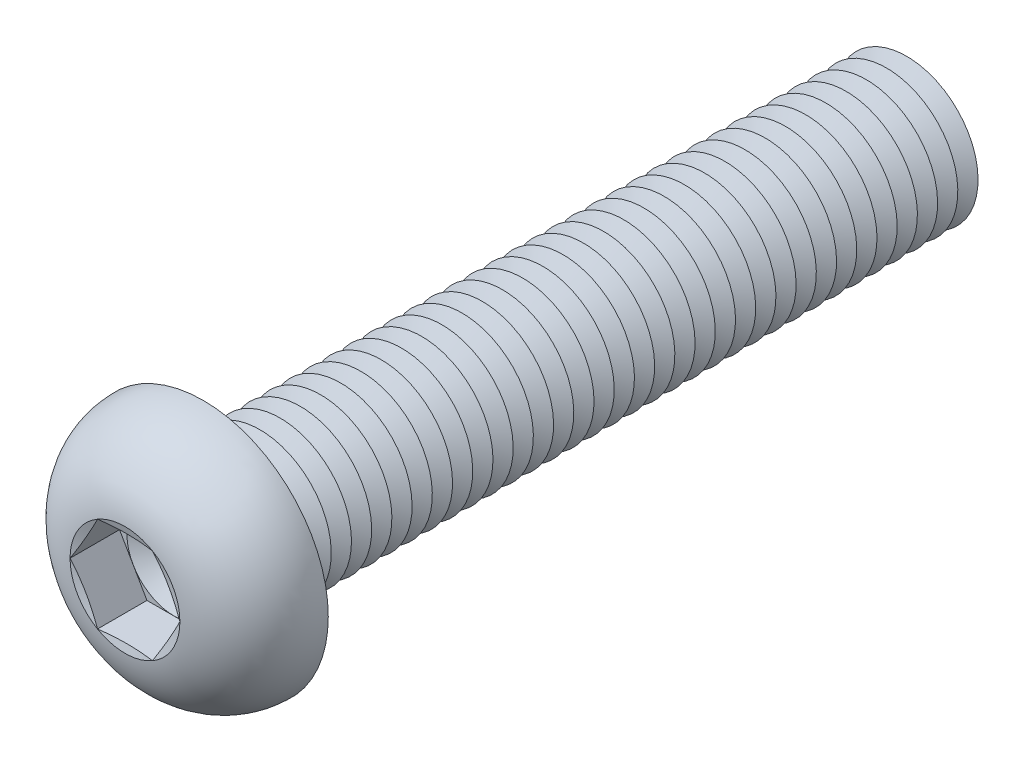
ISO-10303-21;
HEADER;
FILE_DESCRIPTION(('STEP AP214'),'2;1');
FILE_NAME('part.step','',(''),(''),'','','');
FILE_SCHEMA(('AUTOMOTIVE_DESIGN { 1 0 10303 214 1 1 1 1 }'));
ENDSEC;
DATA;
#1=APPLICATION_CONTEXT('core data for automotive mechanical design processes');
#2=APPLICATION_PROTOCOL_DEFINITION('international standard','automotive_design',2000,#1);
#3=PRODUCT_CONTEXT('',#1,'mechanical');
#4=PRODUCT('Part','Part','',(#3));
#5=PRODUCT_RELATED_PRODUCT_CATEGORY('part','',(#4));
#6=PRODUCT_DEFINITION_FORMATION('','',#4);
#7=PRODUCT_DEFINITION_CONTEXT('part definition',#1,'design');
#8=PRODUCT_DEFINITION('design','',#6,#7);
#9=PRODUCT_DEFINITION_SHAPE('','',#8);
#10=(LENGTH_UNIT() NAMED_UNIT(*) SI_UNIT(.MILLI.,.METRE.));
#11=(NAMED_UNIT(*) PLANE_ANGLE_UNIT() SI_UNIT($,.RADIAN.));
#12=(NAMED_UNIT(*) SI_UNIT($,.STERADIAN.) SOLID_ANGLE_UNIT());
#13=UNCERTAINTY_MEASURE_WITH_UNIT(LENGTH_MEASURE(1.E-05),#10,'distance_accuracy_value','');
#14=(GEOMETRIC_REPRESENTATION_CONTEXT(3) GLOBAL_UNCERTAINTY_ASSIGNED_CONTEXT((#13)) GLOBAL_UNIT_ASSIGNED_CONTEXT((#10,
#11,#12)) REPRESENTATION_CONTEXT('',''));
#15=CARTESIAN_POINT('',(0.,0.,0.));
#16=DIRECTION('',(0.,0.,1.));
#17=DIRECTION('',(1.,0.,0.));
#18=AXIS2_PLACEMENT_3D('',#15,#16,#17);
#19=CARTESIAN_POINT('',(0.,0.,2.43999999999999));
#20=DIRECTION('',(0.,0.,1.));
#21=DIRECTION('',(1.,0.,0.));
#22=AXIS2_PLACEMENT_3D('',#19,#20,#21);
#23=PLANE('',#22);
#24=CARTESIAN_POINT('',(0.,0.,2.43999999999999));
#25=DIRECTION('',(0.,0.,1.));
#26=DIRECTION('',(1.,0.,0.));
#27=AXIS2_PLACEMENT_3D('',#24,#25,#26);
#28=CIRCLE('',#27,3.99999813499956);
#29=CARTESIAN_POINT('',(3.4641,1.99999906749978,2.43999999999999));
#30=VERTEX_POINT('',#29);
#31=CARTESIAN_POINT('',(0.,3.99999813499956,2.43999999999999));
#32=VERTEX_POINT('',#31);
#33=EDGE_CURVE('E118',#30,#32,#28,.T.);
#34=ORIENTED_EDGE('',*,*,#33,.F.);
#35=DIRECTION('',(-0.5,0.866025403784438,0.));
#36=VECTOR('',#35,1.);
#37=CARTESIAN_POINT('',(4.6188,0.,2.43999999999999));
#38=LINE('',#37,#36);
#39=CARTESIAN_POINT('',(2.3094,3.99999813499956,2.43999999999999));
#40=VERTEX_POINT('',#39);
#41=EDGE_CURVE('E125',#30,#40,#38,.T.);
#42=ORIENTED_EDGE('',*,*,#41,.T.);
#43=DIRECTION('',(-1.,0.,0.));
#44=VECTOR('',#43,1.);
#45=CARTESIAN_POINT('',(2.3094,3.99999813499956,2.43999999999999));
#46=LINE('',#45,#44);
#47=EDGE_CURVE('E136',#40,#32,#46,.T.);
#48=ORIENTED_EDGE('',*,*,#47,.T.);
#49=EDGE_LOOP('',(#34,#42,#48));
#50=FACE_BOUND('',#49,.T.);
#51=ADVANCED_FACE('F39',(#50),#23,.T.);
#52=CARTESIAN_POINT('',(0.,0.,2.43999999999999));
#53=DIRECTION('',(0.,0.,1.));
#54=DIRECTION('',(1.,0.,0.));
#55=AXIS2_PLACEMENT_3D('',#52,#53,#54);
#56=CIRCLE('',#55,3.99999813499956);
#57=CARTESIAN_POINT('',(-3.4641,1.99999906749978,2.43999999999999));
#58=VERTEX_POINT('',#57);
#59=EDGE_CURVE('E11',#32,#58,#56,.T.);
#60=ORIENTED_EDGE('',*,*,#59,.F.);
#61=CARTESIAN_POINT('',(-2.3094,3.99999813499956,2.43999999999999));
#62=VERTEX_POINT('',#61);
#63=EDGE_CURVE('E131',#32,#62,#46,.T.);
#64=ORIENTED_EDGE('',*,*,#63,.T.);
#65=DIRECTION('',(-0.5,-0.866025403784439,0.));
#66=VECTOR('',#65,1.);
#67=CARTESIAN_POINT('',(-2.3094,3.99999813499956,2.43999999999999));
#68=LINE('',#67,#66);
#69=EDGE_CURVE('E134',#62,#58,#68,.T.);
#70=ORIENTED_EDGE('',*,*,#69,.T.);
#71=EDGE_LOOP('',(#60,#64,#70));
#72=FACE_BOUND('',#71,.T.);
#73=ADVANCED_FACE('F130',(#72),#23,.T.);
#74=CARTESIAN_POINT('',(-3.4641,-1.99999906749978,2.43999999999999));
#75=VERTEX_POINT('',#74);
#76=EDGE_CURVE('E49',#58,#75,#56,.T.);
#77=ORIENTED_EDGE('',*,*,#76,.F.);
#78=CARTESIAN_POINT('',(-4.6188,0.,2.43999999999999));
#79=VERTEX_POINT('',#78);
#80=EDGE_CURVE('E143',#58,#79,#68,.T.);
#81=ORIENTED_EDGE('',*,*,#80,.T.);
#82=DIRECTION('',(0.5,-0.866025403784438,0.));
#83=VECTOR('',#82,1.);
#84=CARTESIAN_POINT('',(-4.6188,0.,2.43999999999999));
#85=LINE('',#84,#83);
#86=EDGE_CURVE('E152',#79,#75,#85,.T.);
#87=ORIENTED_EDGE('',*,*,#86,.T.);
#88=EDGE_LOOP('',(#77,#81,#87));
#89=FACE_BOUND('',#88,.T.);
#90=ADVANCED_FACE('F552',(#89),#23,.T.);
#91=CARTESIAN_POINT('',(0.,-3.99999813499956,2.43999999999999));
#92=VERTEX_POINT('',#91);
#93=EDGE_CURVE('E536',#75,#92,#56,.T.);
#94=ORIENTED_EDGE('',*,*,#93,.F.);
#95=CARTESIAN_POINT('',(-2.3094,-3.99999813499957,2.43999999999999));
#96=VERTEX_POINT('',#95);
#97=EDGE_CURVE('E151',#75,#96,#85,.T.);
#98=ORIENTED_EDGE('',*,*,#97,.T.);
#99=DIRECTION('',(1.,0.,0.));
#100=VECTOR('',#99,1.);
#101=CARTESIAN_POINT('',(-2.3094,-3.99999813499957,2.43999999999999));
#102=LINE('',#101,#100);
#103=EDGE_CURVE('E157',#96,#92,#102,.T.);
#104=ORIENTED_EDGE('',*,*,#103,.T.);
#105=EDGE_LOOP('',(#94,#98,#104));
#106=FACE_BOUND('',#105,.T.);
#107=ADVANCED_FACE('F545',(#106),#23,.T.);
#108=CARTESIAN_POINT('',(3.4641,-1.99999906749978,2.43999999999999));
#109=VERTEX_POINT('',#108);
#110=EDGE_CURVE('E56',#92,#109,#56,.T.);
#111=ORIENTED_EDGE('',*,*,#110,.F.);
#112=CARTESIAN_POINT('',(2.3094,-3.99999813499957,2.43999999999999));
#113=VERTEX_POINT('',#112);
#114=EDGE_CURVE('E156',#92,#113,#102,.T.);
#115=ORIENTED_EDGE('',*,*,#114,.T.);
#116=DIRECTION('',(0.5,0.866025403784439,0.));
#117=VECTOR('',#116,1.);
#118=CARTESIAN_POINT('',(2.3094,-3.99999813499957,2.43999999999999));
#119=LINE('',#118,#117);
#120=EDGE_CURVE('E162',#113,#109,#119,.T.);
#121=ORIENTED_EDGE('',*,*,#120,.T.);
#122=EDGE_LOOP('',(#111,#115,#121));
#123=FACE_BOUND('',#122,.T.);
#124=ADVANCED_FACE('F621',(#123),#23,.T.);
#125=CARTESIAN_POINT('',(0.,0.,6.59999999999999));
#126=DIRECTION('',(0.,0.,1.));
#127=DIRECTION('',(0.,-1.,0.));
#128=AXIS2_PLACEMENT_3D('',#125,#126,#127);
#129=CONICAL_SURFACE('',#128,4.6188,1.30899693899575);
#130=CARTESIAN_POINT('',(4.61891547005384,-0.00020000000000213,6.6000309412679));
#131=CARTESIAN_POINT('',(4.52300232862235,0.165926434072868,6.57431944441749));
#132=CARTESIAN_POINT('',(4.42691527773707,0.332354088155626,6.55097758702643));
#133=CARTESIAN_POINT('',(4.23440181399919,0.665797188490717,6.50996805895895));
#134=CARTESIAN_POINT('',(4.13797527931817,0.832812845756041,6.49230269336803));
#135=CARTESIAN_POINT('',(3.94536752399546,1.16641926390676,6.46367750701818));
#136=CARTESIAN_POINT('',(3.84918760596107,1.33300776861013,6.45268354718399));
#137=CARTESIAN_POINT('',(3.65670510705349,1.66639723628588,6.4379417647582));
#138=CARTESIAN_POINT('',(3.56040255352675,1.83319815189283,6.43419253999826));
#139=CARTESIAN_POINT('',(3.36779744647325,2.16679998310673,6.43419253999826));
#140=CARTESIAN_POINT('',(3.2714948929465,2.33360089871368,6.4379417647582));
#141=CARTESIAN_POINT('',(3.07901239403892,2.66699036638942,6.45268354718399));
#142=CARTESIAN_POINT('',(2.98283247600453,2.8335788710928,6.46367750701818));
#143=CARTESIAN_POINT('',(2.79022472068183,3.16718528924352,6.49230269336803));
#144=CARTESIAN_POINT('',(2.69379818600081,3.33420094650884,6.50996805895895));
#145=CARTESIAN_POINT('',(2.50128472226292,3.66764404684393,6.55097758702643));
#146=CARTESIAN_POINT('',(2.40519767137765,3.83407170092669,6.57431944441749));
#147=CARTESIAN_POINT('',(2.30928452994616,4.00019813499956,6.6000309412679));
#148=B_SPLINE_CURVE_WITH_KNOTS('',3,(#130,#131,#132,#133,#134,#135,#136,#137,#138,#139,#140,
#141,#142,#143,#144,#145,#146,#147),.UNSPECIFIED.,.F.,.F.,(4,2,2,2,2,2,2,2,4),(0.,
0.580655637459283,1.16154676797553,1.73943971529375,2.31722080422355,2.89500189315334,
3.47289484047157,4.05378597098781,4.63444160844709),.UNSPECIFIED.);
#149=CARTESIAN_POINT('',(4.6188,0.,6.59999999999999));
#150=VERTEX_POINT('',#149);
#151=CARTESIAN_POINT('',(2.30940000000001,3.99999813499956,6.6));
#152=VERTEX_POINT('',#151);
#153=EDGE_CURVE('E222',#150,#152,#148,.T.);
#154=ORIENTED_EDGE('',*,*,#153,.F.);
#155=CARTESIAN_POINT('',(0.,0.,6.59999999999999));
#156=DIRECTION('',(0.,0.,-1.));
#157=DIRECTION('',(0.,1.,0.));
#158=AXIS2_PLACEMENT_3D('',#155,#156,#157);
#159=CIRCLE('',#158,4.6188);
#160=EDGE_CURVE('E517',#152,#150,#159,.T.);
#161=ORIENTED_EDGE('',*,*,#160,.F.);
#162=EDGE_LOOP('',(#154,#161));
#163=FACE_BOUND('',#162,.T.);
#164=ADVANCED_FACE('F625',(#163),#129,.F.);
#165=CARTESIAN_POINT('',(2.30928452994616,-4.00019813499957,6.6000309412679));
#166=CARTESIAN_POINT('',(2.40519767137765,-3.8340717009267,6.57431944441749));
#167=CARTESIAN_POINT('',(2.50128472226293,-3.66764404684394,6.55097758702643));
#168=CARTESIAN_POINT('',(2.69379818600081,-3.33420094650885,6.50996805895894));
#169=CARTESIAN_POINT('',(2.79022472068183,-3.16718528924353,6.49230269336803));
#170=CARTESIAN_POINT('',(2.98283247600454,-2.8335788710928,6.46367750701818));
#171=CARTESIAN_POINT('',(3.07901239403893,-2.66699036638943,6.45268354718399));
#172=CARTESIAN_POINT('',(3.2714948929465,-2.33360089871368,6.4379417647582));
#173=CARTESIAN_POINT('',(3.36779744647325,-2.16679998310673,6.43419253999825));
#174=CARTESIAN_POINT('',(3.56040255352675,-1.83319815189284,6.43419253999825));
#175=CARTESIAN_POINT('',(3.6567051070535,-1.66639723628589,6.4379417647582));
#176=CARTESIAN_POINT('',(3.84918760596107,-1.33300776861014,6.45268354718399));
#177=CARTESIAN_POINT('',(3.94536752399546,-1.16641926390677,6.46367750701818));
#178=CARTESIAN_POINT('',(4.13797527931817,-0.832812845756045,6.49230269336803));
#179=CARTESIAN_POINT('',(4.23440181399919,-0.665797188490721,6.50996805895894));
#180=CARTESIAN_POINT('',(4.42691527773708,-0.33235408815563,6.55097758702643));
#181=CARTESIAN_POINT('',(4.52300232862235,-0.165926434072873,6.57431944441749));
#182=CARTESIAN_POINT('',(4.61891547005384,0.000199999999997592,6.6000309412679));
#183=B_SPLINE_CURVE_WITH_KNOTS('',3,(#165,#166,#167,#168,#169,#170,#171,#172,#173,#174,#175,
#176,#177,#178,#179,#180,#181,#182),.UNSPECIFIED.,.F.,.F.,(4,2,2,2,2,2,2,2,4),(0.,
0.580655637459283,1.16154676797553,1.73943971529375,2.31722080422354,2.89500189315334,
3.47289484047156,4.05378597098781,4.63444160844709),.UNSPECIFIED.);
#184=CARTESIAN_POINT('',(2.3094,-3.99999813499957,6.59999999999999));
#185=VERTEX_POINT('',#184);
#186=EDGE_CURVE('E231',#185,#150,#183,.T.);
#187=ORIENTED_EDGE('',*,*,#186,.F.);
#188=EDGE_CURVE('E522',#150,#185,#159,.T.);
#189=ORIENTED_EDGE('',*,*,#188,.F.);
#190=EDGE_LOOP('',(#187,#189));
#191=FACE_BOUND('',#190,.T.);
#192=ADVANCED_FACE('F587',(#191),#129,.F.);
#193=CARTESIAN_POINT('',(-6.96966750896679,-3.99999813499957,7.51561854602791));
#194=CARTESIAN_POINT('',(-6.80094634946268,-3.99999813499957,7.4764117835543));
#195=CARTESIAN_POINT('',(-6.63214895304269,-3.99999813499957,7.43753277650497));
#196=CARTESIAN_POINT('',(-6.29436999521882,-3.99999813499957,7.36057075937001));
#197=CARTESIAN_POINT('',(-6.12538843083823,-3.99999813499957,7.32248776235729));
#198=CARTESIAN_POINT('',(-5.61806276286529,-3.99999813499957,7.20963087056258));
#199=CARTESIAN_POINT('',(-5.27940301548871,-3.99999813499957,7.1362643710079));
#200=CARTESIAN_POINT('',(-4.5977576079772,-3.99999813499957,6.99431141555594));
#201=CARTESIAN_POINT('',(-4.25476115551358,-3.99999813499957,6.92577621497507));
#202=CARTESIAN_POINT('',(-3.56716783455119,-3.99999813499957,6.79696563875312));
#203=CARTESIAN_POINT('',(-3.22257082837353,-3.99999813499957,6.73669098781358));
#204=CARTESIAN_POINT('',(-2.54069952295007,-3.99999813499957,6.63002020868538));
#205=CARTESIAN_POINT('',(-2.20347918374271,-3.99999813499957,6.58329286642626));
#206=CARTESIAN_POINT('',(-1.6962445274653,-3.99999813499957,6.52585827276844));
#207=CARTESIAN_POINT('',(-1.52694760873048,-3.99999813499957,6.50882377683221));
#208=CARTESIAN_POINT('',(-1.187938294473,-3.99999813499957,6.47963274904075));
#209=CARTESIAN_POINT('',(-1.01822592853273,-3.99999813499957,6.4674758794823));
#210=CARTESIAN_POINT('',(-0.679233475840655,-3.99999813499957,6.44863176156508));
#211=CARTESIAN_POINT('',(-0.509954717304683,-3.99999813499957,6.44192096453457));
#212=CARTESIAN_POINT('',(-0.171265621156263,-3.99999813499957,6.43422163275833));
#213=CARTESIAN_POINT('',(-0.00185528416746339,-3.99999813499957,6.43323307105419));
#214=CARTESIAN_POINT('',(0.336912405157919,-3.99999813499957,6.43703123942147));
#215=CARTESIAN_POINT('',(0.506269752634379,-3.99999813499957,6.44181839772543));
#216=CARTESIAN_POINT('',(0.844732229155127,-3.99999813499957,6.45691823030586));
#217=CARTESIAN_POINT('',(1.01383735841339,-3.99999813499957,6.46723089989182));
#218=CARTESIAN_POINT('',(1.42449950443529,-3.99999813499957,6.49843349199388));
#219=CARTESIAN_POINT('',(1.66585565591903,-3.99999813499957,6.52196685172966));
#220=CARTESIAN_POINT('',(2.14755410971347,-3.99999813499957,6.57749710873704));
#221=CARTESIAN_POINT('',(2.3878964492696,-3.99999813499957,6.60949369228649));
#222=CARTESIAN_POINT('',(2.86835569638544,-3.99999813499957,6.68017769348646));
#223=CARTESIAN_POINT('',(3.10846949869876,-3.99999813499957,6.71888590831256));
#224=CARTESIAN_POINT('',(3.58783416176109,-3.99999813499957,6.80132981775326));
#225=CARTESIAN_POINT('',(3.82708497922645,-3.99999813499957,6.84506576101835));
#226=CARTESIAN_POINT('',(4.30977392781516,-3.99999813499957,6.93726543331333));
#227=CARTESIAN_POINT('',(4.55319689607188,-3.99999813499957,6.98580793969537));
#228=CARTESIAN_POINT('',(5.03943022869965,-3.99999813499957,7.085866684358));
#229=CARTESIAN_POINT('',(5.28224058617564,-3.99999813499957,7.13738295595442));
#230=CARTESIAN_POINT('',(5.76604885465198,-3.99999813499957,7.24238429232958));
#231=CARTESIAN_POINT('',(6.00704943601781,-3.99999813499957,7.29585711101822));
#232=CARTESIAN_POINT('',(6.48863948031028,-3.99999813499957,7.40454827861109));
#233=CARTESIAN_POINT('',(6.72922897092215,-3.99999813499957,7.45976650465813));
#234=CARTESIAN_POINT('',(6.9696675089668,-3.99999813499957,7.51561854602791));
#235=B_SPLINE_CURVE_WITH_KNOTS('',3,(#193,#194,#195,#196,#197,#198,#199,#200,#201,#202,#203,
#204,#205,#206,#207,#208,#209,#210,#211,#212,#213,#214,#215,#216,#217,#218,#219,#220,#221,#222,
#223,#224,#225,#226,#227,#228,#229,#230,#231,#232,#233,#234),.UNSPECIFIED.,.F.,.F.,(4,2,2,2,2,2,
2,2,2,2,2,2,2,2,2,2,2,2,2,2,4),(0.,0.519649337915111,1.03930720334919,2.07882421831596,
3.1280857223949,4.17743921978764,5.19841727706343,5.70881429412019,6.21917596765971,
6.72731891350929,7.23545946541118,7.74363769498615,8.25181549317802,8.97911831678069,
9.70639418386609,10.435965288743,11.1655724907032,11.910195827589,12.6548275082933,
13.395405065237,14.1359306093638),.UNSPECIFIED.);
#236=CARTESIAN_POINT('',(-2.3094,-3.99999813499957,6.59999999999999));
#237=VERTEX_POINT('',#236);
#238=EDGE_CURVE('E566',#237,#185,#235,.T.);
#239=ORIENTED_EDGE('',*,*,#238,.F.);
#240=EDGE_CURVE('E579',#185,#237,#159,.T.);
#241=ORIENTED_EDGE('',*,*,#240,.F.);
#242=EDGE_LOOP('',(#239,#241));
#243=FACE_BOUND('',#242,.T.);
#244=ADVANCED_FACE('F592',(#243),#129,.F.);
#245=CARTESIAN_POINT('',(-4.61891547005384,0.000199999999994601,6.6000309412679));
#246=CARTESIAN_POINT('',(-4.52300232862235,-0.165926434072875,6.57431944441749));
#247=CARTESIAN_POINT('',(-4.42691527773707,-0.332354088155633,6.55097758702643));
#248=CARTESIAN_POINT('',(-4.23440181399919,-0.665797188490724,6.50996805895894));
#249=CARTESIAN_POINT('',(-4.13797527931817,-0.832812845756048,6.49230269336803));
#250=CARTESIAN_POINT('',(-3.94536752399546,-1.16641926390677,6.46367750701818));
#251=CARTESIAN_POINT('',(-3.84918760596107,-1.33300776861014,6.45268354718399));
#252=CARTESIAN_POINT('',(-3.6567051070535,-1.66639723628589,6.4379417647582));
#253=CARTESIAN_POINT('',(-3.56040255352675,-1.83319815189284,6.43419253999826));
#254=CARTESIAN_POINT('',(-3.36779744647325,-2.16679998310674,6.43419253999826));
#255=CARTESIAN_POINT('',(-3.2714948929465,-2.33360089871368,6.4379417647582));
#256=CARTESIAN_POINT('',(-3.07901239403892,-2.66699036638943,6.45268354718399));
#257=CARTESIAN_POINT('',(-2.98283247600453,-2.83357887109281,6.46367750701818));
#258=CARTESIAN_POINT('',(-2.79022472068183,-3.16718528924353,6.49230269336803));
#259=CARTESIAN_POINT('',(-2.69379818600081,-3.33420094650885,6.50996805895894));
#260=CARTESIAN_POINT('',(-2.50128472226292,-3.66764404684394,6.55097758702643));
#261=CARTESIAN_POINT('',(-2.40519767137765,-3.8340717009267,6.57431944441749));
#262=CARTESIAN_POINT('',(-2.30928452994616,-4.00019813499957,6.6000309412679));
#263=B_SPLINE_CURVE_WITH_KNOTS('',3,(#245,#246,#247,#248,#249,#250,#251,#252,#253,#254,#255,
#256,#257,#258,#259,#260,#261,#262),.UNSPECIFIED.,.F.,.F.,(4,2,2,2,2,2,2,2,4),(0.,
0.580655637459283,1.16154676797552,1.73943971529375,2.31722080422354,2.89500189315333,
3.47289484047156,4.0537859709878,4.63444160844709),.UNSPECIFIED.);
#264=CARTESIAN_POINT('',(-4.6188,0.,6.59999999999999));
#265=VERTEX_POINT('',#264);
#266=EDGE_CURVE('E557',#265,#237,#263,.T.);
#267=ORIENTED_EDGE('',*,*,#266,.F.);
#268=EDGE_CURVE('E563',#237,#265,#159,.T.);
#269=ORIENTED_EDGE('',*,*,#268,.F.);
#270=EDGE_LOOP('',(#267,#269));
#271=FACE_BOUND('',#270,.T.);
#272=ADVANCED_FACE('F561',(#271),#129,.F.);
#273=CARTESIAN_POINT('',(-2.30928452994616,4.00019813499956,6.6000309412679));
#274=CARTESIAN_POINT('',(-2.40519767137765,3.83407170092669,6.57431944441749));
#275=CARTESIAN_POINT('',(-2.50128472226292,3.66764404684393,6.55097758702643));
#276=CARTESIAN_POINT('',(-2.69379818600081,3.33420094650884,6.50996805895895));
#277=CARTESIAN_POINT('',(-2.79022472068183,3.16718528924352,6.49230269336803));
#278=CARTESIAN_POINT('',(-2.98283247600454,2.8335788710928,6.46367750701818));
#279=CARTESIAN_POINT('',(-3.07901239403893,2.66699036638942,6.45268354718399));
#280=CARTESIAN_POINT('',(-3.2714948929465,2.33360089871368,6.4379417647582));
#281=CARTESIAN_POINT('',(-3.36779744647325,2.16679998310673,6.43419253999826));
#282=CARTESIAN_POINT('',(-3.56040255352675,1.83319815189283,6.43419253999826));
#283=CARTESIAN_POINT('',(-3.6567051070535,1.66639723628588,6.4379417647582));
#284=CARTESIAN_POINT('',(-3.84918760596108,1.33300776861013,6.45268354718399));
#285=CARTESIAN_POINT('',(-3.94536752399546,1.16641926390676,6.46367750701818));
#286=CARTESIAN_POINT('',(-4.13797527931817,0.832812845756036,6.49230269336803));
#287=CARTESIAN_POINT('',(-4.23440181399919,0.665797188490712,6.50996805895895));
#288=CARTESIAN_POINT('',(-4.42691527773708,0.332354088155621,6.55097758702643));
#289=CARTESIAN_POINT('',(-4.52300232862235,0.165926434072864,6.57431944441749));
#290=CARTESIAN_POINT('',(-4.61891547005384,-0.000200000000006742,6.6000309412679));
#291=B_SPLINE_CURVE_WITH_KNOTS('',3,(#273,#274,#275,#276,#277,#278,#279,#280,#281,#282,#283,
#284,#285,#286,#287,#288,#289,#290),.UNSPECIFIED.,.F.,.F.,(4,2,2,2,2,2,2,2,4),(0.,
0.580655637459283,1.16154676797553,1.73943971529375,2.31722080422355,2.89500189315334,
3.47289484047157,4.05378597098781,4.63444160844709),.UNSPECIFIED.);
#292=CARTESIAN_POINT('',(-2.3094,3.99999813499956,6.59999999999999));
#293=VERTEX_POINT('',#292);
#294=EDGE_CURVE('E195',#293,#265,#291,.T.);
#295=ORIENTED_EDGE('',*,*,#294,.F.);
#296=EDGE_CURVE('E569',#265,#293,#159,.T.);
#297=ORIENTED_EDGE('',*,*,#296,.F.);
#298=EDGE_LOOP('',(#295,#297));
#299=FACE_BOUND('',#298,.T.);
#300=ADVANCED_FACE('F570',(#299),#129,.F.);
#301=CARTESIAN_POINT('',(0.,0.,-54.05));
#302=DIRECTION('',(0.,0.,1.));
#303=DIRECTION('',(0.,-1.,0.));
#304=AXIS2_PLACEMENT_3D('',#301,#302,#303);
#305=CONICAL_SURFACE('',#304,5.99999999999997,1.0471975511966);
#306=CARTESIAN_POINT('',(0.,0.,-54.9));
#307=DIRECTION('',(0.,0.,1.));
#308=DIRECTION('',(0.,-1.,0.));
#309=AXIS2_PLACEMENT_3D('',#306,#307,#308);
#310=CIRCLE('',#309,4.52775681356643);
#311=CARTESIAN_POINT('',(0.,-4.5277568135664,-54.9));
#312=VERTEX_POINT('',#311);
#313=EDGE_CURVE('E488',#312,#312,#310,.T.);
#314=ORIENTED_EDGE('',*,*,#313,.T.);
#315=EDGE_LOOP('',(#314));
#316=FACE_BOUND('',#315,.T.);
#317=CARTESIAN_POINT('',(0.,0.,-54.05));
#318=DIRECTION('',(0.,0.,1.));
#319=DIRECTION('',(0.,-1.,0.));
#320=AXIS2_PLACEMENT_3D('',#317,#318,#319);
#321=CIRCLE('',#320,5.99999999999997);
#322=CARTESIAN_POINT('',(0.,-5.99999999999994,-54.05));
#323=VERTEX_POINT('',#322);
#324=EDGE_CURVE('E484',#323,#323,#321,.T.);
#325=ORIENTED_EDGE('',*,*,#324,.F.);
#326=EDGE_LOOP('',(#325));
#327=FACE_BOUND('',#326,.T.);
#328=ADVANCED_FACE('F649',(#316,#327),#305,.T.);
#329=CARTESIAN_POINT('',(0.,0.,-54.9));
#330=DIRECTION('',(0.,0.,-1.));
#331=DIRECTION('',(0.,1.,0.));
#332=AXIS2_PLACEMENT_3D('',#329,#330,#331);
#333=CONICAL_SURFACE('',#332,4.52775681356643,1.0471975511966);
#334=CARTESIAN_POINT('',(0.,0.,-55.75));
#335=DIRECTION('',(0.,0.,1.));
#336=DIRECTION('',(0.,-1.,0.));
#337=AXIS2_PLACEMENT_3D('',#334,#335,#336);
#338=CIRCLE('',#337,5.99999999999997);
#339=CARTESIAN_POINT('',(0.,-5.99999999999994,-55.75));
#340=VERTEX_POINT('',#339);
#341=EDGE_CURVE('E492',#340,#340,#338,.T.);
#342=ORIENTED_EDGE('',*,*,#341,.T.);
#343=EDGE_LOOP('',(#342));
#344=FACE_BOUND('',#343,.T.);
#345=ORIENTED_EDGE('',*,*,#313,.F.);
#346=EDGE_LOOP('',(#345));
#347=FACE_BOUND('',#346,.T.);
#348=ADVANCED_FACE('F654',(#344,#347),#333,.T.);
#349=CARTESIAN_POINT('',(0.,5.99999999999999,-60.));
#350=DIRECTION('',(0.,0.,-1.));
#351=DIRECTION('',(0.,1.,0.));
#352=AXIS2_PLACEMENT_3D('',#349,#350,#351);
#353=PLANE('',#352);
#354=CARTESIAN_POINT('',(0.,0.,-60.));
#355=DIRECTION('',(0.,0.,1.));
#356=DIRECTION('',(0.,-1.,0.));
#357=AXIS2_PLACEMENT_3D('',#354,#355,#356);
#358=CIRCLE('',#357,4.52775681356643);
#359=CARTESIAN_POINT('',(0.,-4.52775681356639,-60.));
#360=VERTEX_POINT('',#359);
#361=EDGE_CURVE('E512',#360,#360,#358,.T.);
#362=ORIENTED_EDGE('',*,*,#361,.F.);
#363=EDGE_LOOP('',(#362));
#364=FACE_BOUND('',#363,.T.);
#365=ADVANCED_FACE('F829',(#364),#353,.T.);
#366=CARTESIAN_POINT('',(0.,0.,-59.15));
#367=DIRECTION('',(0.,0.,1.));
#368=DIRECTION('',(0.,-1.,0.));
#369=AXIS2_PLACEMENT_3D('',#366,#367,#368);
#370=CONICAL_SURFACE('',#369,5.99999999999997,1.0471975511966);
#371=ORIENTED_EDGE('',*,*,#361,.T.);
#372=EDGE_LOOP('',(#371));
#373=FACE_BOUND('',#372,.T.);
#374=CARTESIAN_POINT('',(0.,0.,-59.15));
#375=DIRECTION('',(0.,0.,1.));
#376=DIRECTION('',(0.,-1.,0.));
#377=AXIS2_PLACEMENT_3D('',#374,#375,#376);
#378=CIRCLE('',#377,5.99999999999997);
#379=CARTESIAN_POINT('',(0.,-5.99999999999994,-59.15));
#380=VERTEX_POINT('',#379);
#381=EDGE_CURVE('E508',#380,#380,#378,.T.);
#382=ORIENTED_EDGE('',*,*,#381,.F.);
#383=EDGE_LOOP('',(#382));
#384=FACE_BOUND('',#383,.T.);
#385=ADVANCED_FACE('F822',(#373,#384),#370,.T.);
#386=CARTESIAN_POINT('',(0.,0.,-58.3));
#387=DIRECTION('',(0.,0.,-1.));
#388=DIRECTION('',(0.,1.,0.));
#389=AXIS2_PLACEMENT_3D('',#386,#387,#388);
#390=CONICAL_SURFACE('',#389,4.52775681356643,1.0471975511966);
#391=ORIENTED_EDGE('',*,*,#381,.T.);
#392=EDGE_LOOP('',(#391));
#393=FACE_BOUND('',#392,.T.);
#394=CARTESIAN_POINT('',(0.,0.,-58.3));
#395=DIRECTION('',(0.,0.,1.));
#396=DIRECTION('',(0.,-1.,0.));
#397=AXIS2_PLACEMENT_3D('',#394,#395,#396);
#398=CIRCLE('',#397,4.52775681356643);
#399=CARTESIAN_POINT('',(0.,-4.5277568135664,-58.3));
#400=VERTEX_POINT('',#399);
#401=EDGE_CURVE('E504',#400,#400,#398,.T.);
#402=ORIENTED_EDGE('',*,*,#401,.F.);
#403=EDGE_LOOP('',(#402));
#404=FACE_BOUND('',#403,.T.);
#405=ADVANCED_FACE('F828',(#393,#404),#390,.T.);
#406=CARTESIAN_POINT('',(0.,0.,-57.45));
#407=DIRECTION('',(0.,0.,1.));
#408=DIRECTION('',(0.,-1.,0.));
#409=AXIS2_PLACEMENT_3D('',#406,#407,#408);
#410=CONICAL_SURFACE('',#409,5.99999999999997,1.0471975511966);
#411=ORIENTED_EDGE('',*,*,#401,.T.);
#412=EDGE_LOOP('',(#411));
#413=FACE_BOUND('',#412,.T.);
#414=CARTESIAN_POINT('',(0.,0.,-57.45));
#415=DIRECTION('',(0.,0.,1.));
#416=DIRECTION('',(0.,-1.,0.));
#417=AXIS2_PLACEMENT_3D('',#414,#415,#416);
#418=CIRCLE('',#417,5.99999999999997);
#419=CARTESIAN_POINT('',(0.,-5.99999999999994,-57.45));
#420=VERTEX_POINT('',#419);
#421=EDGE_CURVE('E500',#420,#420,#418,.T.);
#422=ORIENTED_EDGE('',*,*,#421,.F.);
#423=EDGE_LOOP('',(#422));
#424=FACE_BOUND('',#423,.T.);
#425=ADVANCED_FACE('F860',(#413,#424),#410,.T.);
#426=CARTESIAN_POINT('',(0.,0.,-56.6));
#427=DIRECTION('',(0.,0.,-1.));
#428=DIRECTION('',(0.,1.,0.));
#429=AXIS2_PLACEMENT_3D('',#426,#427,#428);
#430=CONICAL_SURFACE('',#429,4.52775681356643,1.0471975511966);
#431=ORIENTED_EDGE('',*,*,#421,.T.);
#432=EDGE_LOOP('',(#431));
#433=FACE_BOUND('',#432,.T.);
#434=CARTESIAN_POINT('',(0.,0.,-56.6));
#435=DIRECTION('',(0.,0.,1.));
#436=DIRECTION('',(0.,-1.,0.));
#437=AXIS2_PLACEMENT_3D('',#434,#435,#436);
#438=CIRCLE('',#437,4.52775681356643);
#439=CARTESIAN_POINT('',(0.,-4.5277568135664,-56.6));
#440=VERTEX_POINT('',#439);
#441=EDGE_CURVE('E496',#440,#440,#438,.T.);
#442=ORIENTED_EDGE('',*,*,#441,.F.);
#443=EDGE_LOOP('',(#442));
#444=FACE_BOUND('',#443,.T.);
#445=ADVANCED_FACE('F870',(#433,#444),#430,.T.);
#446=CARTESIAN_POINT('',(0.,0.,-55.75));
#447=DIRECTION('',(0.,0.,1.));
#448=DIRECTION('',(0.,-1.,0.));
#449=AXIS2_PLACEMENT_3D('',#446,#447,#448);
#450=CONICAL_SURFACE('',#449,5.99999999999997,1.0471975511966);
#451=ORIENTED_EDGE('',*,*,#441,.T.);
#452=EDGE_LOOP('',(#451));
#453=FACE_BOUND('',#452,.T.);
#454=ORIENTED_EDGE('',*,*,#341,.F.);
#455=EDGE_LOOP('',(#454));
#456=FACE_BOUND('',#455,.T.);
#457=ADVANCED_FACE('F880',(#453,#456),#450,.T.);
#458=CARTESIAN_POINT('',(0.,0.,-52.35));
#459=DIRECTION('',(0.,0.,1.));
#460=DIRECTION('',(0.,-1.,0.));
#461=AXIS2_PLACEMENT_3D('',#458,#459,#460);
#462=CONICAL_SURFACE('',#461,5.99999999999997,1.0471975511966);
#463=CARTESIAN_POINT('',(0.,0.,-53.2));
#464=DIRECTION('',(0.,0.,1.));
#465=DIRECTION('',(0.,-1.,0.));
#466=AXIS2_PLACEMENT_3D('',#463,#464,#465);
#467=CIRCLE('',#466,4.52775681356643);
#468=CARTESIAN_POINT('',(0.,-4.5277568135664,-53.2));
#469=VERTEX_POINT('',#468);
#470=EDGE_CURVE('E481',#469,#469,#467,.T.);
#471=ORIENTED_EDGE('',*,*,#470,.T.);
#472=EDGE_LOOP('',(#471));
#473=FACE_BOUND('',#472,.T.);
#474=CARTESIAN_POINT('',(0.,0.,-52.35));
#475=DIRECTION('',(0.,0.,1.));
#476=DIRECTION('',(0.,-1.,0.));
#477=AXIS2_PLACEMENT_3D('',#474,#475,#476);
#478=CIRCLE('',#477,5.99999999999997);
#479=CARTESIAN_POINT('',(0.,-5.99999999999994,-52.35));
#480=VERTEX_POINT('',#479);
#481=EDGE_CURVE('E477',#480,#480,#478,.T.);
#482=ORIENTED_EDGE('',*,*,#481,.F.);
#483=EDGE_LOOP('',(#482));
#484=FACE_BOUND('',#483,.T.);
#485=ADVANCED_FACE('F890',(#473,#484),#462,.T.);
#486=CARTESIAN_POINT('',(0.,0.,-53.2));
#487=DIRECTION('',(0.,0.,-1.));
#488=DIRECTION('',(0.,1.,0.));
#489=AXIS2_PLACEMENT_3D('',#486,#487,#488);
#490=CONICAL_SURFACE('',#489,4.52775681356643,1.0471975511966);
#491=ORIENTED_EDGE('',*,*,#324,.T.);
#492=EDGE_LOOP('',(#491));
#493=FACE_BOUND('',#492,.T.);
#494=ORIENTED_EDGE('',*,*,#470,.F.);
#495=EDGE_LOOP('',(#494));
#496=FACE_BOUND('',#495,.T.);
#497=ADVANCED_FACE('F900',(#493,#496),#490,.T.);
#498=CARTESIAN_POINT('',(0.,0.,-50.65));
#499=DIRECTION('',(0.,0.,1.));
#500=DIRECTION('',(0.,-1.,0.));
#501=AXIS2_PLACEMENT_3D('',#498,#499,#500);
#502=CONICAL_SURFACE('',#501,5.99999999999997,1.0471975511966);
#503=CARTESIAN_POINT('',(0.,0.,-51.5));
#504=DIRECTION('',(0.,0.,1.));
#505=DIRECTION('',(0.,-1.,0.));
#506=AXIS2_PLACEMENT_3D('',#503,#504,#505);
#507=CIRCLE('',#506,4.52775681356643);
#508=CARTESIAN_POINT('',(0.,-4.5277568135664,-51.5));
#509=VERTEX_POINT('',#508);
#510=EDGE_CURVE('E473',#509,#509,#507,.T.);
#511=ORIENTED_EDGE('',*,*,#510,.T.);
#512=EDGE_LOOP('',(#511));
#513=FACE_BOUND('',#512,.T.);
#514=CARTESIAN_POINT('',(0.,0.,-50.65));
#515=DIRECTION('',(0.,0.,1.));
#516=DIRECTION('',(0.,-1.,0.));
#517=AXIS2_PLACEMENT_3D('',#514,#515,#516);
#518=CIRCLE('',#517,5.99999999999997);
#519=CARTESIAN_POINT('',(0.,-5.99999999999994,-50.65));
#520=VERTEX_POINT('',#519);
#521=EDGE_CURVE('E469',#520,#520,#518,.T.);
#522=ORIENTED_EDGE('',*,*,#521,.F.);
#523=EDGE_LOOP('',(#522));
#524=FACE_BOUND('',#523,.T.);
#525=ADVANCED_FACE('F910',(#513,#524),#502,.T.);
#526=CARTESIAN_POINT('',(0.,0.,-51.5));
#527=DIRECTION('',(0.,0.,-1.));
#528=DIRECTION('',(0.,1.,0.));
#529=AXIS2_PLACEMENT_3D('',#526,#527,#528);
#530=CONICAL_SURFACE('',#529,4.52775681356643,1.0471975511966);
#531=ORIENTED_EDGE('',*,*,#481,.T.);
#532=EDGE_LOOP('',(#531));
#533=FACE_BOUND('',#532,.T.);
#534=ORIENTED_EDGE('',*,*,#510,.F.);
#535=EDGE_LOOP('',(#534));
#536=FACE_BOUND('',#535,.T.);
#537=ADVANCED_FACE('F920',(#533,#536),#530,.T.);
#538=CARTESIAN_POINT('',(0.,0.,-48.95));
#539=DIRECTION('',(0.,0.,1.));
#540=DIRECTION('',(0.,-1.,0.));
#541=AXIS2_PLACEMENT_3D('',#538,#539,#540);
#542=CONICAL_SURFACE('',#541,5.99999999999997,1.0471975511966);
#543=CARTESIAN_POINT('',(0.,0.,-49.8));
#544=DIRECTION('',(0.,0.,1.));
#545=DIRECTION('',(0.,-1.,0.));
#546=AXIS2_PLACEMENT_3D('',#543,#544,#545);
#547=CIRCLE('',#546,4.52775681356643);
#548=CARTESIAN_POINT('',(0.,-4.5277568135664,-49.8));
#549=VERTEX_POINT('',#548);
#550=EDGE_CURVE('E465',#549,#549,#547,.T.);
#551=ORIENTED_EDGE('',*,*,#550,.T.);
#552=EDGE_LOOP('',(#551));
#553=FACE_BOUND('',#552,.T.);
#554=CARTESIAN_POINT('',(0.,0.,-48.95));
#555=DIRECTION('',(0.,0.,1.));
#556=DIRECTION('',(0.,-1.,0.));
#557=AXIS2_PLACEMENT_3D('',#554,#555,#556);
#558=CIRCLE('',#557,5.99999999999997);
#559=CARTESIAN_POINT('',(0.,-5.99999999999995,-48.95));
#560=VERTEX_POINT('',#559);
#561=EDGE_CURVE('E461',#560,#560,#558,.T.);
#562=ORIENTED_EDGE('',*,*,#561,.F.);
#563=EDGE_LOOP('',(#562));
#564=FACE_BOUND('',#563,.T.);
#565=ADVANCED_FACE('F930',(#553,#564),#542,.T.);
#566=CARTESIAN_POINT('',(0.,0.,-49.8));
#567=DIRECTION('',(0.,0.,-1.));
#568=DIRECTION('',(0.,1.,0.));
#569=AXIS2_PLACEMENT_3D('',#566,#567,#568);
#570=CONICAL_SURFACE('',#569,4.52775681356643,1.0471975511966);
#571=ORIENTED_EDGE('',*,*,#521,.T.);
#572=EDGE_LOOP('',(#571));
#573=FACE_BOUND('',#572,.T.);
#574=ORIENTED_EDGE('',*,*,#550,.F.);
#575=EDGE_LOOP('',(#574));
#576=FACE_BOUND('',#575,.T.);
#577=ADVANCED_FACE('F940',(#573,#576),#570,.T.);
#578=CARTESIAN_POINT('',(0.,0.,-47.25));
#579=DIRECTION('',(0.,0.,1.));
#580=DIRECTION('',(0.,-1.,0.));
#581=AXIS2_PLACEMENT_3D('',#578,#579,#580);
#582=CONICAL_SURFACE('',#581,5.99999999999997,1.0471975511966);
#583=CARTESIAN_POINT('',(0.,0.,-48.1));
#584=DIRECTION('',(0.,0.,1.));
#585=DIRECTION('',(0.,-1.,0.));
#586=AXIS2_PLACEMENT_3D('',#583,#584,#585);
#587=CIRCLE('',#586,4.52775681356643);
#588=CARTESIAN_POINT('',(0.,-4.5277568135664,-48.1));
#589=VERTEX_POINT('',#588);
#590=EDGE_CURVE('E457',#589,#589,#587,.T.);
#591=ORIENTED_EDGE('',*,*,#590,.T.);
#592=EDGE_LOOP('',(#591));
#593=FACE_BOUND('',#592,.T.);
#594=CARTESIAN_POINT('',(0.,0.,-47.25));
#595=DIRECTION('',(0.,0.,1.));
#596=DIRECTION('',(0.,-1.,0.));
#597=AXIS2_PLACEMENT_3D('',#594,#595,#596);
#598=CIRCLE('',#597,5.99999999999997);
#599=CARTESIAN_POINT('',(0.,-5.99999999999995,-47.25));
#600=VERTEX_POINT('',#599);
#601=EDGE_CURVE('E453',#600,#600,#598,.T.);
#602=ORIENTED_EDGE('',*,*,#601,.F.);
#603=EDGE_LOOP('',(#602));
#604=FACE_BOUND('',#603,.T.);
#605=ADVANCED_FACE('F950',(#593,#604),#582,.T.);
#606=CARTESIAN_POINT('',(0.,0.,-48.1));
#607=DIRECTION('',(0.,0.,-1.));
#608=DIRECTION('',(0.,1.,0.));
#609=AXIS2_PLACEMENT_3D('',#606,#607,#608);
#610=CONICAL_SURFACE('',#609,4.52775681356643,1.0471975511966);
#611=ORIENTED_EDGE('',*,*,#561,.T.);
#612=EDGE_LOOP('',(#611));
#613=FACE_BOUND('',#612,.T.);
#614=ORIENTED_EDGE('',*,*,#590,.F.);
#615=EDGE_LOOP('',(#614));
#616=FACE_BOUND('',#615,.T.);
#617=ADVANCED_FACE('F960',(#613,#616),#610,.T.);
#618=CARTESIAN_POINT('',(0.,0.,-45.55));
#619=DIRECTION('',(0.,0.,1.));
#620=DIRECTION('',(0.,-1.,0.));
#621=AXIS2_PLACEMENT_3D('',#618,#619,#620);
#622=CONICAL_SURFACE('',#621,5.99999999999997,1.0471975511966);
#623=CARTESIAN_POINT('',(0.,0.,-46.4));
#624=DIRECTION('',(0.,0.,1.));
#625=DIRECTION('',(0.,-1.,0.));
#626=AXIS2_PLACEMENT_3D('',#623,#624,#625);
#627=CIRCLE('',#626,4.52775681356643);
#628=CARTESIAN_POINT('',(0.,-4.5277568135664,-46.4));
#629=VERTEX_POINT('',#628);
#630=EDGE_CURVE('E449',#629,#629,#627,.T.);
#631=ORIENTED_EDGE('',*,*,#630,.T.);
#632=EDGE_LOOP('',(#631));
#633=FACE_BOUND('',#632,.T.);
#634=CARTESIAN_POINT('',(0.,0.,-45.55));
#635=DIRECTION('',(0.,0.,1.));
#636=DIRECTION('',(0.,-1.,0.));
#637=AXIS2_PLACEMENT_3D('',#634,#635,#636);
#638=CIRCLE('',#637,5.99999999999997);
#639=CARTESIAN_POINT('',(0.,-5.99999999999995,-45.55));
#640=VERTEX_POINT('',#639);
#641=EDGE_CURVE('E445',#640,#640,#638,.T.);
#642=ORIENTED_EDGE('',*,*,#641,.F.);
#643=EDGE_LOOP('',(#642));
#644=FACE_BOUND('',#643,.T.);
#645=ADVANCED_FACE('F970',(#633,#644),#622,.T.);
#646=CARTESIAN_POINT('',(0.,0.,-46.4));
#647=DIRECTION('',(0.,0.,-1.));
#648=DIRECTION('',(0.,1.,0.));
#649=AXIS2_PLACEMENT_3D('',#646,#647,#648);
#650=CONICAL_SURFACE('',#649,4.52775681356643,1.0471975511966);
#651=ORIENTED_EDGE('',*,*,#601,.T.);
#652=EDGE_LOOP('',(#651));
#653=FACE_BOUND('',#652,.T.);
#654=ORIENTED_EDGE('',*,*,#630,.F.);
#655=EDGE_LOOP('',(#654));
#656=FACE_BOUND('',#655,.T.);
#657=ADVANCED_FACE('F980',(#653,#656),#650,.T.);
#658=CARTESIAN_POINT('',(0.,0.,-43.85));
#659=DIRECTION('',(0.,0.,1.));
#660=DIRECTION('',(0.,-1.,0.));
#661=AXIS2_PLACEMENT_3D('',#658,#659,#660);
#662=CONICAL_SURFACE('',#661,5.99999999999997,1.0471975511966);
#663=CARTESIAN_POINT('',(0.,0.,-44.7));
#664=DIRECTION('',(0.,0.,1.));
#665=DIRECTION('',(0.,-1.,0.));
#666=AXIS2_PLACEMENT_3D('',#663,#664,#665);
#667=CIRCLE('',#666,4.52775681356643);
#668=CARTESIAN_POINT('',(0.,-4.5277568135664,-44.7));
#669=VERTEX_POINT('',#668);
#670=EDGE_CURVE('E441',#669,#669,#667,.T.);
#671=ORIENTED_EDGE('',*,*,#670,.T.);
#672=EDGE_LOOP('',(#671));
#673=FACE_BOUND('',#672,.T.);
#674=CARTESIAN_POINT('',(0.,0.,-43.85));
#675=DIRECTION('',(0.,0.,1.));
#676=DIRECTION('',(0.,-1.,0.));
#677=AXIS2_PLACEMENT_3D('',#674,#675,#676);
#678=CIRCLE('',#677,5.99999999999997);
#679=CARTESIAN_POINT('',(0.,-5.99999999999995,-43.85));
#680=VERTEX_POINT('',#679);
#681=EDGE_CURVE('E437',#680,#680,#678,.T.);
#682=ORIENTED_EDGE('',*,*,#681,.F.);
#683=EDGE_LOOP('',(#682));
#684=FACE_BOUND('',#683,.T.);
#685=ADVANCED_FACE('F990',(#673,#684),#662,.T.);
#686=CARTESIAN_POINT('',(0.,0.,-44.7));
#687=DIRECTION('',(0.,0.,-1.));
#688=DIRECTION('',(0.,1.,0.));
#689=AXIS2_PLACEMENT_3D('',#686,#687,#688);
#690=CONICAL_SURFACE('',#689,4.52775681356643,1.0471975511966);
#691=ORIENTED_EDGE('',*,*,#641,.T.);
#692=EDGE_LOOP('',(#691));
#693=FACE_BOUND('',#692,.T.);
#694=ORIENTED_EDGE('',*,*,#670,.F.);
#695=EDGE_LOOP('',(#694));
#696=FACE_BOUND('',#695,.T.);
#697=ADVANCED_FACE('F1000',(#693,#696),#690,.T.);
#698=CARTESIAN_POINT('',(0.,0.,-42.15));
#699=DIRECTION('',(0.,0.,1.));
#700=DIRECTION('',(0.,-1.,0.));
#701=AXIS2_PLACEMENT_3D('',#698,#699,#700);
#702=CONICAL_SURFACE('',#701,5.99999999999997,1.0471975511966);
#703=CARTESIAN_POINT('',(0.,0.,-43.));
#704=DIRECTION('',(0.,0.,1.));
#705=DIRECTION('',(0.,-1.,0.));
#706=AXIS2_PLACEMENT_3D('',#703,#704,#705);
#707=CIRCLE('',#706,4.52775681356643);
#708=CARTESIAN_POINT('',(0.,-4.5277568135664,-43.));
#709=VERTEX_POINT('',#708);
#710=EDGE_CURVE('E433',#709,#709,#707,.T.);
#711=ORIENTED_EDGE('',*,*,#710,.T.);
#712=EDGE_LOOP('',(#711));
#713=FACE_BOUND('',#712,.T.);
#714=CARTESIAN_POINT('',(0.,0.,-42.15));
#715=DIRECTION('',(0.,0.,1.));
#716=DIRECTION('',(0.,-1.,0.));
#717=AXIS2_PLACEMENT_3D('',#714,#715,#716);
#718=CIRCLE('',#717,5.99999999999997);
#719=CARTESIAN_POINT('',(0.,-5.99999999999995,-42.15));
#720=VERTEX_POINT('',#719);
#721=EDGE_CURVE('E429',#720,#720,#718,.T.);
#722=ORIENTED_EDGE('',*,*,#721,.F.);
#723=EDGE_LOOP('',(#722));
#724=FACE_BOUND('',#723,.T.);
#725=ADVANCED_FACE('F1010',(#713,#724),#702,.T.);
#726=CARTESIAN_POINT('',(0.,0.,-43.));
#727=DIRECTION('',(0.,0.,-1.));
#728=DIRECTION('',(0.,1.,0.));
#729=AXIS2_PLACEMENT_3D('',#726,#727,#728);
#730=CONICAL_SURFACE('',#729,4.52775681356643,1.0471975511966);
#731=ORIENTED_EDGE('',*,*,#681,.T.);
#732=EDGE_LOOP('',(#731));
#733=FACE_BOUND('',#732,.T.);
#734=ORIENTED_EDGE('',*,*,#710,.F.);
#735=EDGE_LOOP('',(#734));
#736=FACE_BOUND('',#735,.T.);
#737=ADVANCED_FACE('F1020',(#733,#736),#730,.T.);
#738=CARTESIAN_POINT('',(0.,0.,-40.45));
#739=DIRECTION('',(0.,0.,1.));
#740=DIRECTION('',(0.,-1.,0.));
#741=AXIS2_PLACEMENT_3D('',#738,#739,#740);
#742=CONICAL_SURFACE('',#741,5.99999999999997,1.0471975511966);
#743=CARTESIAN_POINT('',(0.,0.,-41.3));
#744=DIRECTION('',(0.,0.,1.));
#745=DIRECTION('',(0.,-1.,0.));
#746=AXIS2_PLACEMENT_3D('',#743,#744,#745);
#747=CIRCLE('',#746,4.52775681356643);
#748=CARTESIAN_POINT('',(0.,-4.5277568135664,-41.3));
#749=VERTEX_POINT('',#748);
#750=EDGE_CURVE('E425',#749,#749,#747,.T.);
#751=ORIENTED_EDGE('',*,*,#750,.T.);
#752=EDGE_LOOP('',(#751));
#753=FACE_BOUND('',#752,.T.);
#754=CARTESIAN_POINT('',(0.,0.,-40.45));
#755=DIRECTION('',(0.,0.,1.));
#756=DIRECTION('',(0.,-1.,0.));
#757=AXIS2_PLACEMENT_3D('',#754,#755,#756);
#758=CIRCLE('',#757,5.99999999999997);
#759=CARTESIAN_POINT('',(0.,-5.99999999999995,-40.45));
#760=VERTEX_POINT('',#759);
#761=EDGE_CURVE('E421',#760,#760,#758,.T.);
#762=ORIENTED_EDGE('',*,*,#761,.F.);
#763=EDGE_LOOP('',(#762));
#764=FACE_BOUND('',#763,.T.);
#765=ADVANCED_FACE('F1030',(#753,#764),#742,.T.);
#766=CARTESIAN_POINT('',(0.,0.,-41.3));
#767=DIRECTION('',(0.,0.,-1.));
#768=DIRECTION('',(0.,1.,0.));
#769=AXIS2_PLACEMENT_3D('',#766,#767,#768);
#770=CONICAL_SURFACE('',#769,4.52775681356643,1.0471975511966);
#771=ORIENTED_EDGE('',*,*,#721,.T.);
#772=EDGE_LOOP('',(#771));
#773=FACE_BOUND('',#772,.T.);
#774=ORIENTED_EDGE('',*,*,#750,.F.);
#775=EDGE_LOOP('',(#774));
#776=FACE_BOUND('',#775,.T.);
#777=ADVANCED_FACE('F1040',(#773,#776),#770,.T.);
#778=CARTESIAN_POINT('',(0.,0.,-38.75));
#779=DIRECTION('',(0.,0.,1.));
#780=DIRECTION('',(0.,-1.,0.));
#781=AXIS2_PLACEMENT_3D('',#778,#779,#780);
#782=CONICAL_SURFACE('',#781,5.99999999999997,1.0471975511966);
#783=CARTESIAN_POINT('',(0.,0.,-39.6));
#784=DIRECTION('',(0.,0.,1.));
#785=DIRECTION('',(0.,-1.,0.));
#786=AXIS2_PLACEMENT_3D('',#783,#784,#785);
#787=CIRCLE('',#786,4.52775681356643);
#788=CARTESIAN_POINT('',(0.,-4.52775681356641,-39.6));
#789=VERTEX_POINT('',#788);
#790=EDGE_CURVE('E417',#789,#789,#787,.T.);
#791=ORIENTED_EDGE('',*,*,#790,.T.);
#792=EDGE_LOOP('',(#791));
#793=FACE_BOUND('',#792,.T.);
#794=CARTESIAN_POINT('',(0.,0.,-38.75));
#795=DIRECTION('',(0.,0.,1.));
#796=DIRECTION('',(0.,-1.,0.));
#797=AXIS2_PLACEMENT_3D('',#794,#795,#796);
#798=CIRCLE('',#797,5.99999999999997);
#799=CARTESIAN_POINT('',(0.,-5.99999999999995,-38.75));
#800=VERTEX_POINT('',#799);
#801=EDGE_CURVE('E413',#800,#800,#798,.T.);
#802=ORIENTED_EDGE('',*,*,#801,.F.);
#803=EDGE_LOOP('',(#802));
#804=FACE_BOUND('',#803,.T.);
#805=ADVANCED_FACE('F1050',(#793,#804),#782,.T.);
#806=CARTESIAN_POINT('',(0.,0.,-39.6));
#807=DIRECTION('',(0.,0.,-1.));
#808=DIRECTION('',(0.,1.,0.));
#809=AXIS2_PLACEMENT_3D('',#806,#807,#808);
#810=CONICAL_SURFACE('',#809,4.52775681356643,1.0471975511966);
#811=ORIENTED_EDGE('',*,*,#761,.T.);
#812=EDGE_LOOP('',(#811));
#813=FACE_BOUND('',#812,.T.);
#814=ORIENTED_EDGE('',*,*,#790,.F.);
#815=EDGE_LOOP('',(#814));
#816=FACE_BOUND('',#815,.T.);
#817=ADVANCED_FACE('F1060',(#813,#816),#810,.T.);
#818=CARTESIAN_POINT('',(0.,0.,-37.05));
#819=DIRECTION('',(0.,0.,1.));
#820=DIRECTION('',(0.,-1.,0.));
#821=AXIS2_PLACEMENT_3D('',#818,#819,#820);
#822=CONICAL_SURFACE('',#821,5.99999999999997,1.0471975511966);
#823=CARTESIAN_POINT('',(0.,0.,-37.9));
#824=DIRECTION('',(0.,0.,1.));
#825=DIRECTION('',(0.,-1.,0.));
#826=AXIS2_PLACEMENT_3D('',#823,#824,#825);
#827=CIRCLE('',#826,4.52775681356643);
#828=CARTESIAN_POINT('',(0.,-4.52775681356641,-37.9));
#829=VERTEX_POINT('',#828);
#830=EDGE_CURVE('E409',#829,#829,#827,.T.);
#831=ORIENTED_EDGE('',*,*,#830,.T.);
#832=EDGE_LOOP('',(#831));
#833=FACE_BOUND('',#832,.T.);
#834=CARTESIAN_POINT('',(0.,0.,-37.05));
#835=DIRECTION('',(0.,0.,1.));
#836=DIRECTION('',(0.,-1.,0.));
#837=AXIS2_PLACEMENT_3D('',#834,#835,#836);
#838=CIRCLE('',#837,5.99999999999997);
#839=CARTESIAN_POINT('',(0.,-5.99999999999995,-37.05));
#840=VERTEX_POINT('',#839);
#841=EDGE_CURVE('E405',#840,#840,#838,.T.);
#842=ORIENTED_EDGE('',*,*,#841,.F.);
#843=EDGE_LOOP('',(#842));
#844=FACE_BOUND('',#843,.T.);
#845=ADVANCED_FACE('F1070',(#833,#844),#822,.T.);
#846=CARTESIAN_POINT('',(0.,0.,-37.9));
#847=DIRECTION('',(0.,0.,-1.));
#848=DIRECTION('',(0.,1.,0.));
#849=AXIS2_PLACEMENT_3D('',#846,#847,#848);
#850=CONICAL_SURFACE('',#849,4.52775681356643,1.0471975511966);
#851=ORIENTED_EDGE('',*,*,#801,.T.);
#852=EDGE_LOOP('',(#851));
#853=FACE_BOUND('',#852,.T.);
#854=ORIENTED_EDGE('',*,*,#830,.F.);
#855=EDGE_LOOP('',(#854));
#856=FACE_BOUND('',#855,.T.);
#857=ADVANCED_FACE('F1080',(#853,#856),#850,.T.);
#858=CARTESIAN_POINT('',(0.,0.,-35.35));
#859=DIRECTION('',(0.,0.,1.));
#860=DIRECTION('',(0.,-1.,0.));
#861=AXIS2_PLACEMENT_3D('',#858,#859,#860);
#862=CONICAL_SURFACE('',#861,5.99999999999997,1.0471975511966);
#863=CARTESIAN_POINT('',(0.,0.,-36.2));
#864=DIRECTION('',(0.,0.,1.));
#865=DIRECTION('',(0.,-1.,0.));
#866=AXIS2_PLACEMENT_3D('',#863,#864,#865);
#867=CIRCLE('',#866,4.52775681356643);
#868=CARTESIAN_POINT('',(0.,-4.52775681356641,-36.2));
#869=VERTEX_POINT('',#868);
#870=EDGE_CURVE('E401',#869,#869,#867,.T.);
#871=ORIENTED_EDGE('',*,*,#870,.T.);
#872=EDGE_LOOP('',(#871));
#873=FACE_BOUND('',#872,.T.);
#874=CARTESIAN_POINT('',(0.,0.,-35.35));
#875=DIRECTION('',(0.,0.,1.));
#876=DIRECTION('',(0.,-1.,0.));
#877=AXIS2_PLACEMENT_3D('',#874,#875,#876);
#878=CIRCLE('',#877,5.99999999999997);
#879=CARTESIAN_POINT('',(0.,-5.99999999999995,-35.35));
#880=VERTEX_POINT('',#879);
#881=EDGE_CURVE('E397',#880,#880,#878,.T.);
#882=ORIENTED_EDGE('',*,*,#881,.F.);
#883=EDGE_LOOP('',(#882));
#884=FACE_BOUND('',#883,.T.);
#885=ADVANCED_FACE('F1090',(#873,#884),#862,.T.);
#886=CARTESIAN_POINT('',(0.,0.,-36.2));
#887=DIRECTION('',(0.,0.,-1.));
#888=DIRECTION('',(0.,1.,0.));
#889=AXIS2_PLACEMENT_3D('',#886,#887,#888);
#890=CONICAL_SURFACE('',#889,4.52775681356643,1.0471975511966);
#891=ORIENTED_EDGE('',*,*,#841,.T.);
#892=EDGE_LOOP('',(#891));
#893=FACE_BOUND('',#892,.T.);
#894=ORIENTED_EDGE('',*,*,#870,.F.);
#895=EDGE_LOOP('',(#894));
#896=FACE_BOUND('',#895,.T.);
#897=ADVANCED_FACE('F1100',(#893,#896),#890,.T.);
#898=CARTESIAN_POINT('',(0.,0.,-33.65));
#899=DIRECTION('',(0.,0.,1.));
#900=DIRECTION('',(0.,-1.,0.));
#901=AXIS2_PLACEMENT_3D('',#898,#899,#900);
#902=CONICAL_SURFACE('',#901,5.99999999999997,1.0471975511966);
#903=CARTESIAN_POINT('',(0.,0.,-34.5));
#904=DIRECTION('',(0.,0.,1.));
#905=DIRECTION('',(0.,-1.,0.));
#906=AXIS2_PLACEMENT_3D('',#903,#904,#905);
#907=CIRCLE('',#906,4.52775681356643);
#908=CARTESIAN_POINT('',(0.,-4.52775681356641,-34.5));
#909=VERTEX_POINT('',#908);
#910=EDGE_CURVE('E393',#909,#909,#907,.T.);
#911=ORIENTED_EDGE('',*,*,#910,.T.);
#912=EDGE_LOOP('',(#911));
#913=FACE_BOUND('',#912,.T.);
#914=CARTESIAN_POINT('',(0.,0.,-33.65));
#915=DIRECTION('',(0.,0.,1.));
#916=DIRECTION('',(0.,-1.,0.));
#917=AXIS2_PLACEMENT_3D('',#914,#915,#916);
#918=CIRCLE('',#917,5.99999999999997);
#919=CARTESIAN_POINT('',(0.,-5.99999999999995,-33.65));
#920=VERTEX_POINT('',#919);
#921=EDGE_CURVE('E389',#920,#920,#918,.T.);
#922=ORIENTED_EDGE('',*,*,#921,.F.);
#923=EDGE_LOOP('',(#922));
#924=FACE_BOUND('',#923,.T.);
#925=ADVANCED_FACE('F1110',(#913,#924),#902,.T.);
#926=CARTESIAN_POINT('',(0.,0.,-34.5));
#927=DIRECTION('',(0.,0.,-1.));
#928=DIRECTION('',(0.,1.,0.));
#929=AXIS2_PLACEMENT_3D('',#926,#927,#928);
#930=CONICAL_SURFACE('',#929,4.52775681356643,1.0471975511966);
#931=ORIENTED_EDGE('',*,*,#881,.T.);
#932=EDGE_LOOP('',(#931));
#933=FACE_BOUND('',#932,.T.);
#934=ORIENTED_EDGE('',*,*,#910,.F.);
#935=EDGE_LOOP('',(#934));
#936=FACE_BOUND('',#935,.T.);
#937=ADVANCED_FACE('F1120',(#933,#936),#930,.T.);
#938=CARTESIAN_POINT('',(0.,0.,-31.95));
#939=DIRECTION('',(0.,0.,1.));
#940=DIRECTION('',(0.,-1.,0.));
#941=AXIS2_PLACEMENT_3D('',#938,#939,#940);
#942=CONICAL_SURFACE('',#941,5.99999999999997,1.0471975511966);
#943=CARTESIAN_POINT('',(0.,0.,-32.8));
#944=DIRECTION('',(0.,0.,1.));
#945=DIRECTION('',(0.,-1.,0.));
#946=AXIS2_PLACEMENT_3D('',#943,#944,#945);
#947=CIRCLE('',#946,4.52775681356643);
#948=CARTESIAN_POINT('',(0.,-4.52775681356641,-32.8));
#949=VERTEX_POINT('',#948);
#950=EDGE_CURVE('E385',#949,#949,#947,.T.);
#951=ORIENTED_EDGE('',*,*,#950,.T.);
#952=EDGE_LOOP('',(#951));
#953=FACE_BOUND('',#952,.T.);
#954=CARTESIAN_POINT('',(0.,0.,-31.95));
#955=DIRECTION('',(0.,0.,1.));
#956=DIRECTION('',(0.,-1.,0.));
#957=AXIS2_PLACEMENT_3D('',#954,#955,#956);
#958=CIRCLE('',#957,5.99999999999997);
#959=CARTESIAN_POINT('',(0.,-5.99999999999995,-31.95));
#960=VERTEX_POINT('',#959);
#961=EDGE_CURVE('E381',#960,#960,#958,.T.);
#962=ORIENTED_EDGE('',*,*,#961,.F.);
#963=EDGE_LOOP('',(#962));
#964=FACE_BOUND('',#963,.T.);
#965=ADVANCED_FACE('F1130',(#953,#964),#942,.T.);
#966=CARTESIAN_POINT('',(0.,0.,-32.8));
#967=DIRECTION('',(0.,0.,-1.));
#968=DIRECTION('',(0.,1.,0.));
#969=AXIS2_PLACEMENT_3D('',#966,#967,#968);
#970=CONICAL_SURFACE('',#969,4.52775681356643,1.0471975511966);
#971=ORIENTED_EDGE('',*,*,#921,.T.);
#972=EDGE_LOOP('',(#971));
#973=FACE_BOUND('',#972,.T.);
#974=ORIENTED_EDGE('',*,*,#950,.F.);
#975=EDGE_LOOP('',(#974));
#976=FACE_BOUND('',#975,.T.);
#977=ADVANCED_FACE('F1140',(#973,#976),#970,.T.);
#978=CARTESIAN_POINT('',(0.,0.,-30.25));
#979=DIRECTION('',(0.,0.,1.));
#980=DIRECTION('',(0.,-1.,0.));
#981=AXIS2_PLACEMENT_3D('',#978,#979,#980);
#982=CONICAL_SURFACE('',#981,5.99999999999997,1.0471975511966);
#983=CARTESIAN_POINT('',(0.,0.,-31.1));
#984=DIRECTION('',(0.,0.,1.));
#985=DIRECTION('',(0.,-1.,0.));
#986=AXIS2_PLACEMENT_3D('',#983,#984,#985);
#987=CIRCLE('',#986,4.52775681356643);
#988=CARTESIAN_POINT('',(0.,-4.52775681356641,-31.1));
#989=VERTEX_POINT('',#988);
#990=EDGE_CURVE('E377',#989,#989,#987,.T.);
#991=ORIENTED_EDGE('',*,*,#990,.T.);
#992=EDGE_LOOP('',(#991));
#993=FACE_BOUND('',#992,.T.);
#994=CARTESIAN_POINT('',(0.,0.,-30.25));
#995=DIRECTION('',(0.,0.,1.));
#996=DIRECTION('',(0.,-1.,0.));
#997=AXIS2_PLACEMENT_3D('',#994,#995,#996);
#998=CIRCLE('',#997,5.99999999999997);
#999=CARTESIAN_POINT('',(0.,-5.99999999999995,-30.25));
#1000=VERTEX_POINT('',#999);
#1001=EDGE_CURVE('E373',#1000,#1000,#998,.T.);
#1002=ORIENTED_EDGE('',*,*,#1001,.F.);
#1003=EDGE_LOOP('',(#1002));
#1004=FACE_BOUND('',#1003,.T.);
#1005=ADVANCED_FACE('F1150',(#993,#1004),#982,.T.);
#1006=CARTESIAN_POINT('',(0.,0.,-31.1));
#1007=DIRECTION('',(0.,0.,-1.));
#1008=DIRECTION('',(0.,1.,0.));
#1009=AXIS2_PLACEMENT_3D('',#1006,#1007,#1008);
#1010=CONICAL_SURFACE('',#1009,4.52775681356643,1.0471975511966);
#1011=ORIENTED_EDGE('',*,*,#961,.T.);
#1012=EDGE_LOOP('',(#1011));
#1013=FACE_BOUND('',#1012,.T.);
#1014=ORIENTED_EDGE('',*,*,#990,.F.);
#1015=EDGE_LOOP('',(#1014));
#1016=FACE_BOUND('',#1015,.T.);
#1017=ADVANCED_FACE('F1160',(#1013,#1016),#1010,.T.);
#1018=CARTESIAN_POINT('',(0.,0.,-28.55));
#1019=DIRECTION('',(0.,0.,1.));
#1020=DIRECTION('',(0.,-1.,0.));
#1021=AXIS2_PLACEMENT_3D('',#1018,#1019,#1020);
#1022=CONICAL_SURFACE('',#1021,5.99999999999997,1.0471975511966);
#1023=CARTESIAN_POINT('',(0.,0.,-29.4));
#1024=DIRECTION('',(0.,0.,1.));
#1025=DIRECTION('',(0.,-1.,0.));
#1026=AXIS2_PLACEMENT_3D('',#1023,#1024,#1025);
#1027=CIRCLE('',#1026,4.52775681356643);
#1028=CARTESIAN_POINT('',(0.,-4.52775681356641,-29.4));
#1029=VERTEX_POINT('',#1028);
#1030=EDGE_CURVE('E369',#1029,#1029,#1027,.T.);
#1031=ORIENTED_EDGE('',*,*,#1030,.T.);
#1032=EDGE_LOOP('',(#1031));
#1033=FACE_BOUND('',#1032,.T.);
#1034=CARTESIAN_POINT('',(0.,0.,-28.55));
#1035=DIRECTION('',(0.,0.,1.));
#1036=DIRECTION('',(0.,-1.,0.));
#1037=AXIS2_PLACEMENT_3D('',#1034,#1035,#1036);
#1038=CIRCLE('',#1037,5.99999999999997);
#1039=CARTESIAN_POINT('',(0.,-5.99999999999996,-28.55));
#1040=VERTEX_POINT('',#1039);
#1041=EDGE_CURVE('E365',#1040,#1040,#1038,.T.);
#1042=ORIENTED_EDGE('',*,*,#1041,.F.);
#1043=EDGE_LOOP('',(#1042));
#1044=FACE_BOUND('',#1043,.T.);
#1045=ADVANCED_FACE('F1170',(#1033,#1044),#1022,.T.);
#1046=CARTESIAN_POINT('',(0.,0.,-29.4));
#1047=DIRECTION('',(0.,0.,-1.));
#1048=DIRECTION('',(0.,1.,0.));
#1049=AXIS2_PLACEMENT_3D('',#1046,#1047,#1048);
#1050=CONICAL_SURFACE('',#1049,4.52775681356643,1.0471975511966);
#1051=ORIENTED_EDGE('',*,*,#1001,.T.);
#1052=EDGE_LOOP('',(#1051));
#1053=FACE_BOUND('',#1052,.T.);
#1054=ORIENTED_EDGE('',*,*,#1030,.F.);
#1055=EDGE_LOOP('',(#1054));
#1056=FACE_BOUND('',#1055,.T.);
#1057=ADVANCED_FACE('F1180',(#1053,#1056),#1050,.T.);
#1058=CARTESIAN_POINT('',(0.,0.,-26.85));
#1059=DIRECTION('',(0.,0.,1.));
#1060=DIRECTION('',(0.,-1.,0.));
#1061=AXIS2_PLACEMENT_3D('',#1058,#1059,#1060);
#1062=CONICAL_SURFACE('',#1061,5.99999999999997,1.0471975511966);
#1063=CARTESIAN_POINT('',(0.,0.,-27.7));
#1064=DIRECTION('',(0.,0.,1.));
#1065=DIRECTION('',(0.,-1.,0.));
#1066=AXIS2_PLACEMENT_3D('',#1063,#1064,#1065);
#1067=CIRCLE('',#1066,4.52775681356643);
#1068=CARTESIAN_POINT('',(0.,-4.52775681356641,-27.7));
#1069=VERTEX_POINT('',#1068);
#1070=EDGE_CURVE('E361',#1069,#1069,#1067,.T.);
#1071=ORIENTED_EDGE('',*,*,#1070,.T.);
#1072=EDGE_LOOP('',(#1071));
#1073=FACE_BOUND('',#1072,.T.);
#1074=CARTESIAN_POINT('',(0.,0.,-26.85));
#1075=DIRECTION('',(0.,0.,1.));
#1076=DIRECTION('',(0.,-1.,0.));
#1077=AXIS2_PLACEMENT_3D('',#1074,#1075,#1076);
#1078=CIRCLE('',#1077,5.99999999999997);
#1079=CARTESIAN_POINT('',(0.,-5.99999999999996,-26.85));
#1080=VERTEX_POINT('',#1079);
#1081=EDGE_CURVE('E357',#1080,#1080,#1078,.T.);
#1082=ORIENTED_EDGE('',*,*,#1081,.F.);
#1083=EDGE_LOOP('',(#1082));
#1084=FACE_BOUND('',#1083,.T.);
#1085=ADVANCED_FACE('F1190',(#1073,#1084),#1062,.T.);
#1086=CARTESIAN_POINT('',(0.,0.,-27.7));
#1087=DIRECTION('',(0.,0.,-1.));
#1088=DIRECTION('',(0.,1.,0.));
#1089=AXIS2_PLACEMENT_3D('',#1086,#1087,#1088);
#1090=CONICAL_SURFACE('',#1089,4.52775681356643,1.0471975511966);
#1091=ORIENTED_EDGE('',*,*,#1041,.T.);
#1092=EDGE_LOOP('',(#1091));
#1093=FACE_BOUND('',#1092,.T.);
#1094=ORIENTED_EDGE('',*,*,#1070,.F.);
#1095=EDGE_LOOP('',(#1094));
#1096=FACE_BOUND('',#1095,.T.);
#1097=ADVANCED_FACE('F1200',(#1093,#1096),#1090,.T.);
#1098=CARTESIAN_POINT('',(0.,0.,-25.15));
#1099=DIRECTION('',(0.,0.,1.));
#1100=DIRECTION('',(0.,-1.,0.));
#1101=AXIS2_PLACEMENT_3D('',#1098,#1099,#1100);
#1102=CONICAL_SURFACE('',#1101,5.99999999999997,1.0471975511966);
#1103=CARTESIAN_POINT('',(0.,0.,-26.));
#1104=DIRECTION('',(0.,0.,1.));
#1105=DIRECTION('',(0.,-1.,0.));
#1106=AXIS2_PLACEMENT_3D('',#1103,#1104,#1105);
#1107=CIRCLE('',#1106,4.52775681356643);
#1108=CARTESIAN_POINT('',(0.,-4.52775681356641,-26.));
#1109=VERTEX_POINT('',#1108);
#1110=EDGE_CURVE('E353',#1109,#1109,#1107,.T.);
#1111=ORIENTED_EDGE('',*,*,#1110,.T.);
#1112=EDGE_LOOP('',(#1111));
#1113=FACE_BOUND('',#1112,.T.);
#1114=CARTESIAN_POINT('',(0.,0.,-25.15));
#1115=DIRECTION('',(0.,0.,1.));
#1116=DIRECTION('',(0.,-1.,0.));
#1117=AXIS2_PLACEMENT_3D('',#1114,#1115,#1116);
#1118=CIRCLE('',#1117,5.99999999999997);
#1119=CARTESIAN_POINT('',(0.,-5.99999999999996,-25.15));
#1120=VERTEX_POINT('',#1119);
#1121=EDGE_CURVE('E349',#1120,#1120,#1118,.T.);
#1122=ORIENTED_EDGE('',*,*,#1121,.F.);
#1123=EDGE_LOOP('',(#1122));
#1124=FACE_BOUND('',#1123,.T.);
#1125=ADVANCED_FACE('F1210',(#1113,#1124),#1102,.T.);
#1126=CARTESIAN_POINT('',(0.,0.,-26.));
#1127=DIRECTION('',(0.,0.,-1.));
#1128=DIRECTION('',(0.,1.,0.));
#1129=AXIS2_PLACEMENT_3D('',#1126,#1127,#1128);
#1130=CONICAL_SURFACE('',#1129,4.52775681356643,1.0471975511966);
#1131=ORIENTED_EDGE('',*,*,#1081,.T.);
#1132=EDGE_LOOP('',(#1131));
#1133=FACE_BOUND('',#1132,.T.);
#1134=ORIENTED_EDGE('',*,*,#1110,.F.);
#1135=EDGE_LOOP('',(#1134));
#1136=FACE_BOUND('',#1135,.T.);
#1137=ADVANCED_FACE('F1220',(#1133,#1136),#1130,.T.);
#1138=CARTESIAN_POINT('',(0.,0.,-23.45));
#1139=DIRECTION('',(0.,0.,1.));
#1140=DIRECTION('',(0.,-1.,0.));
#1141=AXIS2_PLACEMENT_3D('',#1138,#1139,#1140);
#1142=CONICAL_SURFACE('',#1141,5.99999999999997,1.0471975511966);
#1143=CARTESIAN_POINT('',(0.,0.,-24.3));
#1144=DIRECTION('',(0.,0.,1.));
#1145=DIRECTION('',(0.,-1.,0.));
#1146=AXIS2_PLACEMENT_3D('',#1143,#1144,#1145);
#1147=CIRCLE('',#1146,4.52775681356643);
#1148=CARTESIAN_POINT('',(0.,-4.52775681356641,-24.3));
#1149=VERTEX_POINT('',#1148);
#1150=EDGE_CURVE('E345',#1149,#1149,#1147,.T.);
#1151=ORIENTED_EDGE('',*,*,#1150,.T.);
#1152=EDGE_LOOP('',(#1151));
#1153=FACE_BOUND('',#1152,.T.);
#1154=CARTESIAN_POINT('',(0.,0.,-23.45));
#1155=DIRECTION('',(0.,0.,1.));
#1156=DIRECTION('',(0.,-1.,0.));
#1157=AXIS2_PLACEMENT_3D('',#1154,#1155,#1156);
#1158=CIRCLE('',#1157,5.99999999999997);
#1159=CARTESIAN_POINT('',(0.,-5.99999999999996,-23.45));
#1160=VERTEX_POINT('',#1159);
#1161=EDGE_CURVE('E341',#1160,#1160,#1158,.T.);
#1162=ORIENTED_EDGE('',*,*,#1161,.F.);
#1163=EDGE_LOOP('',(#1162));
#1164=FACE_BOUND('',#1163,.T.);
#1165=ADVANCED_FACE('F1230',(#1153,#1164),#1142,.T.);
#1166=CARTESIAN_POINT('',(0.,0.,-24.3));
#1167=DIRECTION('',(0.,0.,-1.));
#1168=DIRECTION('',(0.,1.,0.));
#1169=AXIS2_PLACEMENT_3D('',#1166,#1167,#1168);
#1170=CONICAL_SURFACE('',#1169,4.52775681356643,1.0471975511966);
#1171=ORIENTED_EDGE('',*,*,#1121,.T.);
#1172=EDGE_LOOP('',(#1171));
#1173=FACE_BOUND('',#1172,.T.);
#1174=ORIENTED_EDGE('',*,*,#1150,.F.);
#1175=EDGE_LOOP('',(#1174));
#1176=FACE_BOUND('',#1175,.T.);
#1177=ADVANCED_FACE('F1240',(#1173,#1176),#1170,.T.);
#1178=CARTESIAN_POINT('',(0.,0.,-21.75));
#1179=DIRECTION('',(0.,0.,1.));
#1180=DIRECTION('',(0.,-1.,0.));
#1181=AXIS2_PLACEMENT_3D('',#1178,#1179,#1180);
#1182=CONICAL_SURFACE('',#1181,5.99999999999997,1.0471975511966);
#1183=CARTESIAN_POINT('',(0.,0.,-22.6));
#1184=DIRECTION('',(0.,0.,1.));
#1185=DIRECTION('',(0.,-1.,0.));
#1186=AXIS2_PLACEMENT_3D('',#1183,#1184,#1185);
#1187=CIRCLE('',#1186,4.52775681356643);
#1188=CARTESIAN_POINT('',(0.,-4.52775681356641,-22.6));
#1189=VERTEX_POINT('',#1188);
#1190=EDGE_CURVE('E337',#1189,#1189,#1187,.T.);
#1191=ORIENTED_EDGE('',*,*,#1190,.T.);
#1192=EDGE_LOOP('',(#1191));
#1193=FACE_BOUND('',#1192,.T.);
#1194=CARTESIAN_POINT('',(0.,0.,-21.75));
#1195=DIRECTION('',(0.,0.,1.));
#1196=DIRECTION('',(0.,-1.,0.));
#1197=AXIS2_PLACEMENT_3D('',#1194,#1195,#1196);
#1198=CIRCLE('',#1197,5.99999999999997);
#1199=CARTESIAN_POINT('',(0.,-5.99999999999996,-21.75));
#1200=VERTEX_POINT('',#1199);
#1201=EDGE_CURVE('E333',#1200,#1200,#1198,.T.);
#1202=ORIENTED_EDGE('',*,*,#1201,.F.);
#1203=EDGE_LOOP('',(#1202));
#1204=FACE_BOUND('',#1203,.T.);
#1205=ADVANCED_FACE('F1250',(#1193,#1204),#1182,.T.);
#1206=CARTESIAN_POINT('',(0.,0.,-22.6));
#1207=DIRECTION('',(0.,0.,-1.));
#1208=DIRECTION('',(0.,1.,0.));
#1209=AXIS2_PLACEMENT_3D('',#1206,#1207,#1208);
#1210=CONICAL_SURFACE('',#1209,4.52775681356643,1.0471975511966);
#1211=ORIENTED_EDGE('',*,*,#1161,.T.);
#1212=EDGE_LOOP('',(#1211));
#1213=FACE_BOUND('',#1212,.T.);
#1214=ORIENTED_EDGE('',*,*,#1190,.F.);
#1215=EDGE_LOOP('',(#1214));
#1216=FACE_BOUND('',#1215,.T.);
#1217=ADVANCED_FACE('F1260',(#1213,#1216),#1210,.T.);
#1218=CARTESIAN_POINT('',(0.,0.,-20.05));
#1219=DIRECTION('',(0.,0.,1.));
#1220=DIRECTION('',(0.,-1.,0.));
#1221=AXIS2_PLACEMENT_3D('',#1218,#1219,#1220);
#1222=CONICAL_SURFACE('',#1221,5.99999999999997,1.0471975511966);
#1223=CARTESIAN_POINT('',(0.,0.,-20.9));
#1224=DIRECTION('',(0.,0.,1.));
#1225=DIRECTION('',(0.,-1.,0.));
#1226=AXIS2_PLACEMENT_3D('',#1223,#1224,#1225);
#1227=CIRCLE('',#1226,4.52775681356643);
#1228=CARTESIAN_POINT('',(0.,-4.52775681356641,-20.9));
#1229=VERTEX_POINT('',#1228);
#1230=EDGE_CURVE('E329',#1229,#1229,#1227,.T.);
#1231=ORIENTED_EDGE('',*,*,#1230,.T.);
#1232=EDGE_LOOP('',(#1231));
#1233=FACE_BOUND('',#1232,.T.);
#1234=CARTESIAN_POINT('',(0.,0.,-20.05));
#1235=DIRECTION('',(0.,0.,1.));
#1236=DIRECTION('',(0.,-1.,0.));
#1237=AXIS2_PLACEMENT_3D('',#1234,#1235,#1236);
#1238=CIRCLE('',#1237,5.99999999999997);
#1239=CARTESIAN_POINT('',(0.,-5.99999999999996,-20.05));
#1240=VERTEX_POINT('',#1239);
#1241=EDGE_CURVE('E325',#1240,#1240,#1238,.T.);
#1242=ORIENTED_EDGE('',*,*,#1241,.F.);
#1243=EDGE_LOOP('',(#1242));
#1244=FACE_BOUND('',#1243,.T.);
#1245=ADVANCED_FACE('F1270',(#1233,#1244),#1222,.T.);
#1246=CARTESIAN_POINT('',(0.,0.,-20.9));
#1247=DIRECTION('',(0.,0.,-1.));
#1248=DIRECTION('',(0.,1.,0.));
#1249=AXIS2_PLACEMENT_3D('',#1246,#1247,#1248);
#1250=CONICAL_SURFACE('',#1249,4.52775681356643,1.0471975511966);
#1251=ORIENTED_EDGE('',*,*,#1201,.T.);
#1252=EDGE_LOOP('',(#1251));
#1253=FACE_BOUND('',#1252,.T.);
#1254=ORIENTED_EDGE('',*,*,#1230,.F.);
#1255=EDGE_LOOP('',(#1254));
#1256=FACE_BOUND('',#1255,.T.);
#1257=ADVANCED_FACE('F1280',(#1253,#1256),#1250,.T.);
#1258=CARTESIAN_POINT('',(0.,0.,-18.35));
#1259=DIRECTION('',(0.,0.,1.));
#1260=DIRECTION('',(0.,-1.,0.));
#1261=AXIS2_PLACEMENT_3D('',#1258,#1259,#1260);
#1262=CONICAL_SURFACE('',#1261,5.99999999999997,1.0471975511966);
#1263=CARTESIAN_POINT('',(0.,0.,-19.2));
#1264=DIRECTION('',(0.,0.,1.));
#1265=DIRECTION('',(0.,-1.,0.));
#1266=AXIS2_PLACEMENT_3D('',#1263,#1264,#1265);
#1267=CIRCLE('',#1266,4.52775681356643);
#1268=CARTESIAN_POINT('',(0.,-4.52775681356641,-19.2));
#1269=VERTEX_POINT('',#1268);
#1270=EDGE_CURVE('E321',#1269,#1269,#1267,.T.);
#1271=ORIENTED_EDGE('',*,*,#1270,.T.);
#1272=EDGE_LOOP('',(#1271));
#1273=FACE_BOUND('',#1272,.T.);
#1274=CARTESIAN_POINT('',(0.,0.,-18.35));
#1275=DIRECTION('',(0.,0.,1.));
#1276=DIRECTION('',(0.,-1.,0.));
#1277=AXIS2_PLACEMENT_3D('',#1274,#1275,#1276);
#1278=CIRCLE('',#1277,5.99999999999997);
#1279=CARTESIAN_POINT('',(0.,-5.99999999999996,-18.35));
#1280=VERTEX_POINT('',#1279);
#1281=EDGE_CURVE('E317',#1280,#1280,#1278,.T.);
#1282=ORIENTED_EDGE('',*,*,#1281,.F.);
#1283=EDGE_LOOP('',(#1282));
#1284=FACE_BOUND('',#1283,.T.);
#1285=ADVANCED_FACE('F1290',(#1273,#1284),#1262,.T.);
#1286=CARTESIAN_POINT('',(0.,0.,-19.2));
#1287=DIRECTION('',(0.,0.,-1.));
#1288=DIRECTION('',(0.,1.,0.));
#1289=AXIS2_PLACEMENT_3D('',#1286,#1287,#1288);
#1290=CONICAL_SURFACE('',#1289,4.52775681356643,1.0471975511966);
#1291=ORIENTED_EDGE('',*,*,#1241,.T.);
#1292=EDGE_LOOP('',(#1291));
#1293=FACE_BOUND('',#1292,.T.);
#1294=ORIENTED_EDGE('',*,*,#1270,.F.);
#1295=EDGE_LOOP('',(#1294));
#1296=FACE_BOUND('',#1295,.T.);
#1297=ADVANCED_FACE('F1300',(#1293,#1296),#1290,.T.);
#1298=CARTESIAN_POINT('',(0.,0.,-16.65));
#1299=DIRECTION('',(0.,0.,1.));
#1300=DIRECTION('',(0.,-1.,0.));
#1301=AXIS2_PLACEMENT_3D('',#1298,#1299,#1300);
#1302=CONICAL_SURFACE('',#1301,5.99999999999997,1.0471975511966);
#1303=CARTESIAN_POINT('',(0.,0.,-17.5));
#1304=DIRECTION('',(0.,0.,1.));
#1305=DIRECTION('',(0.,-1.,0.));
#1306=AXIS2_PLACEMENT_3D('',#1303,#1304,#1305);
#1307=CIRCLE('',#1306,4.52775681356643);
#1308=CARTESIAN_POINT('',(0.,-4.52775681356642,-17.5));
#1309=VERTEX_POINT('',#1308);
#1310=EDGE_CURVE('E313',#1309,#1309,#1307,.T.);
#1311=ORIENTED_EDGE('',*,*,#1310,.T.);
#1312=EDGE_LOOP('',(#1311));
#1313=FACE_BOUND('',#1312,.T.);
#1314=CARTESIAN_POINT('',(0.,0.,-16.65));
#1315=DIRECTION('',(0.,0.,1.));
#1316=DIRECTION('',(0.,-1.,0.));
#1317=AXIS2_PLACEMENT_3D('',#1314,#1315,#1316);
#1318=CIRCLE('',#1317,5.99999999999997);
#1319=CARTESIAN_POINT('',(0.,-5.99999999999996,-16.65));
#1320=VERTEX_POINT('',#1319);
#1321=EDGE_CURVE('E309',#1320,#1320,#1318,.T.);
#1322=ORIENTED_EDGE('',*,*,#1321,.F.);
#1323=EDGE_LOOP('',(#1322));
#1324=FACE_BOUND('',#1323,.T.);
#1325=ADVANCED_FACE('F1310',(#1313,#1324),#1302,.T.);
#1326=CARTESIAN_POINT('',(0.,0.,-17.5));
#1327=DIRECTION('',(0.,0.,-1.));
#1328=DIRECTION('',(0.,1.,0.));
#1329=AXIS2_PLACEMENT_3D('',#1326,#1327,#1328);
#1330=CONICAL_SURFACE('',#1329,4.52775681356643,1.0471975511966);
#1331=ORIENTED_EDGE('',*,*,#1281,.T.);
#1332=EDGE_LOOP('',(#1331));
#1333=FACE_BOUND('',#1332,.T.);
#1334=ORIENTED_EDGE('',*,*,#1310,.F.);
#1335=EDGE_LOOP('',(#1334));
#1336=FACE_BOUND('',#1335,.T.);
#1337=ADVANCED_FACE('F1320',(#1333,#1336),#1330,.T.);
#1338=CARTESIAN_POINT('',(0.,0.,-14.95));
#1339=DIRECTION('',(0.,0.,1.));
#1340=DIRECTION('',(0.,-1.,0.));
#1341=AXIS2_PLACEMENT_3D('',#1338,#1339,#1340);
#1342=CONICAL_SURFACE('',#1341,5.99999999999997,1.0471975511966);
#1343=CARTESIAN_POINT('',(0.,0.,-15.8));
#1344=DIRECTION('',(0.,0.,1.));
#1345=DIRECTION('',(0.,-1.,0.));
#1346=AXIS2_PLACEMENT_3D('',#1343,#1344,#1345);
#1347=CIRCLE('',#1346,4.52775681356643);
#1348=CARTESIAN_POINT('',(0.,-4.52775681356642,-15.8));
#1349=VERTEX_POINT('',#1348);
#1350=EDGE_CURVE('E305',#1349,#1349,#1347,.T.);
#1351=ORIENTED_EDGE('',*,*,#1350,.T.);
#1352=EDGE_LOOP('',(#1351));
#1353=FACE_BOUND('',#1352,.T.);
#1354=CARTESIAN_POINT('',(0.,0.,-14.95));
#1355=DIRECTION('',(0.,0.,1.));
#1356=DIRECTION('',(0.,-1.,0.));
#1357=AXIS2_PLACEMENT_3D('',#1354,#1355,#1356);
#1358=CIRCLE('',#1357,5.99999999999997);
#1359=CARTESIAN_POINT('',(0.,-5.99999999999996,-14.95));
#1360=VERTEX_POINT('',#1359);
#1361=EDGE_CURVE('E301',#1360,#1360,#1358,.T.);
#1362=ORIENTED_EDGE('',*,*,#1361,.F.);
#1363=EDGE_LOOP('',(#1362));
#1364=FACE_BOUND('',#1363,.T.);
#1365=ADVANCED_FACE('F1330',(#1353,#1364),#1342,.T.);
#1366=CARTESIAN_POINT('',(0.,0.,-15.8));
#1367=DIRECTION('',(0.,0.,-1.));
#1368=DIRECTION('',(0.,1.,0.));
#1369=AXIS2_PLACEMENT_3D('',#1366,#1367,#1368);
#1370=CONICAL_SURFACE('',#1369,4.52775681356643,1.0471975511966);
#1371=ORIENTED_EDGE('',*,*,#1321,.T.);
#1372=EDGE_LOOP('',(#1371));
#1373=FACE_BOUND('',#1372,.T.);
#1374=ORIENTED_EDGE('',*,*,#1350,.F.);
#1375=EDGE_LOOP('',(#1374));
#1376=FACE_BOUND('',#1375,.T.);
#1377=ADVANCED_FACE('F1340',(#1373,#1376),#1370,.T.);
#1378=CARTESIAN_POINT('',(0.,0.,-13.25));
#1379=DIRECTION('',(0.,0.,1.));
#1380=DIRECTION('',(0.,-1.,0.));
#1381=AXIS2_PLACEMENT_3D('',#1378,#1379,#1380);
#1382=CONICAL_SURFACE('',#1381,5.99999999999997,1.0471975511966);
#1383=CARTESIAN_POINT('',(0.,0.,-14.1));
#1384=DIRECTION('',(0.,0.,1.));
#1385=DIRECTION('',(0.,-1.,0.));
#1386=AXIS2_PLACEMENT_3D('',#1383,#1384,#1385);
#1387=CIRCLE('',#1386,4.52775681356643);
#1388=CARTESIAN_POINT('',(0.,-4.52775681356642,-14.1));
#1389=VERTEX_POINT('',#1388);
#1390=EDGE_CURVE('E297',#1389,#1389,#1387,.T.);
#1391=ORIENTED_EDGE('',*,*,#1390,.T.);
#1392=EDGE_LOOP('',(#1391));
#1393=FACE_BOUND('',#1392,.T.);
#1394=CARTESIAN_POINT('',(0.,0.,-13.25));
#1395=DIRECTION('',(0.,0.,1.));
#1396=DIRECTION('',(0.,-1.,0.));
#1397=AXIS2_PLACEMENT_3D('',#1394,#1395,#1396);
#1398=CIRCLE('',#1397,5.99999999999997);
#1399=CARTESIAN_POINT('',(0.,-5.99999999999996,-13.25));
#1400=VERTEX_POINT('',#1399);
#1401=EDGE_CURVE('E293',#1400,#1400,#1398,.T.);
#1402=ORIENTED_EDGE('',*,*,#1401,.F.);
#1403=EDGE_LOOP('',(#1402));
#1404=FACE_BOUND('',#1403,.T.);
#1405=ADVANCED_FACE('F1350',(#1393,#1404),#1382,.T.);
#1406=CARTESIAN_POINT('',(0.,0.,-14.1));
#1407=DIRECTION('',(0.,0.,-1.));
#1408=DIRECTION('',(0.,1.,0.));
#1409=AXIS2_PLACEMENT_3D('',#1406,#1407,#1408);
#1410=CONICAL_SURFACE('',#1409,4.52775681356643,1.0471975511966);
#1411=ORIENTED_EDGE('',*,*,#1361,.T.);
#1412=EDGE_LOOP('',(#1411));
#1413=FACE_BOUND('',#1412,.T.);
#1414=ORIENTED_EDGE('',*,*,#1390,.F.);
#1415=EDGE_LOOP('',(#1414));
#1416=FACE_BOUND('',#1415,.T.);
#1417=ADVANCED_FACE('F1360',(#1413,#1416),#1410,.T.);
#1418=CARTESIAN_POINT('',(0.,0.,-11.55));
#1419=DIRECTION('',(0.,0.,1.));
#1420=DIRECTION('',(0.,-1.,0.));
#1421=AXIS2_PLACEMENT_3D('',#1418,#1419,#1420);
#1422=CONICAL_SURFACE('',#1421,5.99999999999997,1.0471975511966);
#1423=CARTESIAN_POINT('',(0.,0.,-12.4));
#1424=DIRECTION('',(0.,0.,1.));
#1425=DIRECTION('',(0.,-1.,0.));
#1426=AXIS2_PLACEMENT_3D('',#1423,#1424,#1425);
#1427=CIRCLE('',#1426,4.52775681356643);
#1428=CARTESIAN_POINT('',(0.,-4.52775681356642,-12.4));
#1429=VERTEX_POINT('',#1428);
#1430=EDGE_CURVE('E289',#1429,#1429,#1427,.T.);
#1431=ORIENTED_EDGE('',*,*,#1430,.T.);
#1432=EDGE_LOOP('',(#1431));
#1433=FACE_BOUND('',#1432,.T.);
#1434=CARTESIAN_POINT('',(0.,0.,-11.55));
#1435=DIRECTION('',(0.,0.,1.));
#1436=DIRECTION('',(0.,-1.,0.));
#1437=AXIS2_PLACEMENT_3D('',#1434,#1435,#1436);
#1438=CIRCLE('',#1437,5.99999999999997);
#1439=CARTESIAN_POINT('',(0.,-5.99999999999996,-11.55));
#1440=VERTEX_POINT('',#1439);
#1441=EDGE_CURVE('E285',#1440,#1440,#1438,.T.);
#1442=ORIENTED_EDGE('',*,*,#1441,.F.);
#1443=EDGE_LOOP('',(#1442));
#1444=FACE_BOUND('',#1443,.T.);
#1445=ADVANCED_FACE('F1370',(#1433,#1444),#1422,.T.);
#1446=CARTESIAN_POINT('',(0.,0.,-12.4));
#1447=DIRECTION('',(0.,0.,-1.));
#1448=DIRECTION('',(0.,1.,0.));
#1449=AXIS2_PLACEMENT_3D('',#1446,#1447,#1448);
#1450=CONICAL_SURFACE('',#1449,4.52775681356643,1.0471975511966);
#1451=ORIENTED_EDGE('',*,*,#1401,.T.);
#1452=EDGE_LOOP('',(#1451));
#1453=FACE_BOUND('',#1452,.T.);
#1454=ORIENTED_EDGE('',*,*,#1430,.F.);
#1455=EDGE_LOOP('',(#1454));
#1456=FACE_BOUND('',#1455,.T.);
#1457=ADVANCED_FACE('F1380',(#1453,#1456),#1450,.T.);
#1458=CARTESIAN_POINT('',(0.,0.,-9.85));
#1459=DIRECTION('',(0.,0.,1.));
#1460=DIRECTION('',(0.,-1.,0.));
#1461=AXIS2_PLACEMENT_3D('',#1458,#1459,#1460);
#1462=CONICAL_SURFACE('',#1461,5.99999999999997,1.0471975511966);
#1463=CARTESIAN_POINT('',(0.,0.,-10.7));
#1464=DIRECTION('',(0.,0.,1.));
#1465=DIRECTION('',(0.,-1.,0.));
#1466=AXIS2_PLACEMENT_3D('',#1463,#1464,#1465);
#1467=CIRCLE('',#1466,4.52775681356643);
#1468=CARTESIAN_POINT('',(0.,-4.52775681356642,-10.7));
#1469=VERTEX_POINT('',#1468);
#1470=EDGE_CURVE('E281',#1469,#1469,#1467,.T.);
#1471=ORIENTED_EDGE('',*,*,#1470,.T.);
#1472=EDGE_LOOP('',(#1471));
#1473=FACE_BOUND('',#1472,.T.);
#1474=CARTESIAN_POINT('',(0.,0.,-9.85));
#1475=DIRECTION('',(0.,0.,1.));
#1476=DIRECTION('',(0.,-1.,0.));
#1477=AXIS2_PLACEMENT_3D('',#1474,#1475,#1476);
#1478=CIRCLE('',#1477,5.99999999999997);
#1479=CARTESIAN_POINT('',(0.,-5.99999999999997,-9.85));
#1480=VERTEX_POINT('',#1479);
#1481=EDGE_CURVE('E277',#1480,#1480,#1478,.T.);
#1482=ORIENTED_EDGE('',*,*,#1481,.F.);
#1483=EDGE_LOOP('',(#1482));
#1484=FACE_BOUND('',#1483,.T.);
#1485=ADVANCED_FACE('F1390',(#1473,#1484),#1462,.T.);
#1486=CARTESIAN_POINT('',(0.,0.,-10.7));
#1487=DIRECTION('',(0.,0.,-1.));
#1488=DIRECTION('',(0.,1.,0.));
#1489=AXIS2_PLACEMENT_3D('',#1486,#1487,#1488);
#1490=CONICAL_SURFACE('',#1489,4.52775681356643,1.0471975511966);
#1491=ORIENTED_EDGE('',*,*,#1441,.T.);
#1492=EDGE_LOOP('',(#1491));
#1493=FACE_BOUND('',#1492,.T.);
#1494=ORIENTED_EDGE('',*,*,#1470,.F.);
#1495=EDGE_LOOP('',(#1494));
#1496=FACE_BOUND('',#1495,.T.);
#1497=ADVANCED_FACE('F1400',(#1493,#1496),#1490,.T.);
#1498=CARTESIAN_POINT('',(0.,0.,-8.15));
#1499=DIRECTION('',(0.,0.,1.));
#1500=DIRECTION('',(0.,-1.,0.));
#1501=AXIS2_PLACEMENT_3D('',#1498,#1499,#1500);
#1502=CONICAL_SURFACE('',#1501,5.99999999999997,1.0471975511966);
#1503=CARTESIAN_POINT('',(0.,0.,-9.));
#1504=DIRECTION('',(0.,0.,1.));
#1505=DIRECTION('',(0.,-1.,0.));
#1506=AXIS2_PLACEMENT_3D('',#1503,#1504,#1505);
#1507=CIRCLE('',#1506,4.52775681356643);
#1508=CARTESIAN_POINT('',(0.,-4.52775681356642,-9.));
#1509=VERTEX_POINT('',#1508);
#1510=EDGE_CURVE('E273',#1509,#1509,#1507,.T.);
#1511=ORIENTED_EDGE('',*,*,#1510,.T.);
#1512=EDGE_LOOP('',(#1511));
#1513=FACE_BOUND('',#1512,.T.);
#1514=CARTESIAN_POINT('',(0.,0.,-8.15));
#1515=DIRECTION('',(0.,0.,1.));
#1516=DIRECTION('',(0.,-1.,0.));
#1517=AXIS2_PLACEMENT_3D('',#1514,#1515,#1516);
#1518=CIRCLE('',#1517,5.99999999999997);
#1519=CARTESIAN_POINT('',(0.,-5.99999999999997,-8.15));
#1520=VERTEX_POINT('',#1519);
#1521=EDGE_CURVE('E269',#1520,#1520,#1518,.T.);
#1522=ORIENTED_EDGE('',*,*,#1521,.F.);
#1523=EDGE_LOOP('',(#1522));
#1524=FACE_BOUND('',#1523,.T.);
#1525=ADVANCED_FACE('F1410',(#1513,#1524),#1502,.T.);
#1526=CARTESIAN_POINT('',(0.,0.,-9.));
#1527=DIRECTION('',(0.,0.,-1.));
#1528=DIRECTION('',(0.,1.,0.));
#1529=AXIS2_PLACEMENT_3D('',#1526,#1527,#1528);
#1530=CONICAL_SURFACE('',#1529,4.52775681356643,1.0471975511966);
#1531=ORIENTED_EDGE('',*,*,#1481,.T.);
#1532=EDGE_LOOP('',(#1531));
#1533=FACE_BOUND('',#1532,.T.);
#1534=ORIENTED_EDGE('',*,*,#1510,.F.);
#1535=EDGE_LOOP('',(#1534));
#1536=FACE_BOUND('',#1535,.T.);
#1537=ADVANCED_FACE('F1420',(#1533,#1536),#1530,.T.);
#1538=CARTESIAN_POINT('',(0.,0.,-6.45));
#1539=DIRECTION('',(0.,0.,1.));
#1540=DIRECTION('',(0.,-1.,0.));
#1541=AXIS2_PLACEMENT_3D('',#1538,#1539,#1540);
#1542=CONICAL_SURFACE('',#1541,5.99999999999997,1.0471975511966);
#1543=CARTESIAN_POINT('',(0.,0.,-7.3));
#1544=DIRECTION('',(0.,0.,1.));
#1545=DIRECTION('',(0.,-1.,0.));
#1546=AXIS2_PLACEMENT_3D('',#1543,#1544,#1545);
#1547=CIRCLE('',#1546,4.52775681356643);
#1548=CARTESIAN_POINT('',(0.,-4.52775681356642,-7.3));
#1549=VERTEX_POINT('',#1548);
#1550=EDGE_CURVE('E265',#1549,#1549,#1547,.T.);
#1551=ORIENTED_EDGE('',*,*,#1550,.T.);
#1552=EDGE_LOOP('',(#1551));
#1553=FACE_BOUND('',#1552,.T.);
#1554=CARTESIAN_POINT('',(0.,0.,-6.45));
#1555=DIRECTION('',(0.,0.,1.));
#1556=DIRECTION('',(0.,-1.,0.));
#1557=AXIS2_PLACEMENT_3D('',#1554,#1555,#1556);
#1558=CIRCLE('',#1557,5.99999999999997);
#1559=CARTESIAN_POINT('',(0.,-5.99999999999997,-6.45));
#1560=VERTEX_POINT('',#1559);
#1561=EDGE_CURVE('E261',#1560,#1560,#1558,.T.);
#1562=ORIENTED_EDGE('',*,*,#1561,.F.);
#1563=EDGE_LOOP('',(#1562));
#1564=FACE_BOUND('',#1563,.T.);
#1565=ADVANCED_FACE('F1430',(#1553,#1564),#1542,.T.);
#1566=CARTESIAN_POINT('',(0.,0.,-7.3));
#1567=DIRECTION('',(0.,0.,-1.));
#1568=DIRECTION('',(0.,1.,0.));
#1569=AXIS2_PLACEMENT_3D('',#1566,#1567,#1568);
#1570=CONICAL_SURFACE('',#1569,4.52775681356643,1.0471975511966);
#1571=ORIENTED_EDGE('',*,*,#1521,.T.);
#1572=EDGE_LOOP('',(#1571));
#1573=FACE_BOUND('',#1572,.T.);
#1574=ORIENTED_EDGE('',*,*,#1550,.F.);
#1575=EDGE_LOOP('',(#1574));
#1576=FACE_BOUND('',#1575,.T.);
#1577=ADVANCED_FACE('F1440',(#1573,#1576),#1570,.T.);
#1578=CARTESIAN_POINT('',(0.,0.,-4.75));
#1579=DIRECTION('',(0.,0.,1.));
#1580=DIRECTION('',(0.,-1.,0.));
#1581=AXIS2_PLACEMENT_3D('',#1578,#1579,#1580);
#1582=CONICAL_SURFACE('',#1581,5.99999999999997,1.0471975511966);
#1583=CARTESIAN_POINT('',(0.,0.,-5.6));
#1584=DIRECTION('',(0.,0.,1.));
#1585=DIRECTION('',(0.,-1.,0.));
#1586=AXIS2_PLACEMENT_3D('',#1583,#1584,#1585);
#1587=CIRCLE('',#1586,4.52775681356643);
#1588=CARTESIAN_POINT('',(0.,-4.52775681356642,-5.6));
#1589=VERTEX_POINT('',#1588);
#1590=EDGE_CURVE('E257',#1589,#1589,#1587,.T.);
#1591=ORIENTED_EDGE('',*,*,#1590,.T.);
#1592=EDGE_LOOP('',(#1591));
#1593=FACE_BOUND('',#1592,.T.);
#1594=CARTESIAN_POINT('',(0.,0.,-4.75));
#1595=DIRECTION('',(0.,0.,1.));
#1596=DIRECTION('',(0.,-1.,0.));
#1597=AXIS2_PLACEMENT_3D('',#1594,#1595,#1596);
#1598=CIRCLE('',#1597,5.99999999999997);
#1599=CARTESIAN_POINT('',(0.,-5.99999999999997,-4.75));
#1600=VERTEX_POINT('',#1599);
#1601=EDGE_CURVE('E253',#1600,#1600,#1598,.T.);
#1602=ORIENTED_EDGE('',*,*,#1601,.F.);
#1603=EDGE_LOOP('',(#1602));
#1604=FACE_BOUND('',#1603,.T.);
#1605=ADVANCED_FACE('F1450',(#1593,#1604),#1582,.T.);
#1606=CARTESIAN_POINT('',(0.,0.,-5.6));
#1607=DIRECTION('',(0.,0.,-1.));
#1608=DIRECTION('',(0.,1.,0.));
#1609=AXIS2_PLACEMENT_3D('',#1606,#1607,#1608);
#1610=CONICAL_SURFACE('',#1609,4.52775681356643,1.0471975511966);
#1611=ORIENTED_EDGE('',*,*,#1561,.T.);
#1612=EDGE_LOOP('',(#1611));
#1613=FACE_BOUND('',#1612,.T.);
#1614=ORIENTED_EDGE('',*,*,#1590,.F.);
#1615=EDGE_LOOP('',(#1614));
#1616=FACE_BOUND('',#1615,.T.);
#1617=ADVANCED_FACE('F1460',(#1613,#1616),#1610,.T.);
#1618=CARTESIAN_POINT('',(0.,0.,-3.05));
#1619=DIRECTION('',(0.,0.,1.));
#1620=DIRECTION('',(0.,-1.,0.));
#1621=AXIS2_PLACEMENT_3D('',#1618,#1619,#1620);
#1622=CONICAL_SURFACE('',#1621,5.99999999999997,1.0471975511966);
#1623=CARTESIAN_POINT('',(0.,0.,-3.9));
#1624=DIRECTION('',(0.,0.,1.));
#1625=DIRECTION('',(0.,-1.,0.));
#1626=AXIS2_PLACEMENT_3D('',#1623,#1624,#1625);
#1627=CIRCLE('',#1626,4.52775681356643);
#1628=CARTESIAN_POINT('',(0.,-4.52775681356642,-3.9));
#1629=VERTEX_POINT('',#1628);
#1630=EDGE_CURVE('E249',#1629,#1629,#1627,.T.);
#1631=ORIENTED_EDGE('',*,*,#1630,.T.);
#1632=EDGE_LOOP('',(#1631));
#1633=FACE_BOUND('',#1632,.T.);
#1634=CARTESIAN_POINT('',(0.,0.,-3.05));
#1635=DIRECTION('',(0.,0.,1.));
#1636=DIRECTION('',(0.,-1.,0.));
#1637=AXIS2_PLACEMENT_3D('',#1634,#1635,#1636);
#1638=CIRCLE('',#1637,5.99999999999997);
#1639=CARTESIAN_POINT('',(0.,-5.99999999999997,-3.05));
#1640=VERTEX_POINT('',#1639);
#1641=EDGE_CURVE('E241',#1640,#1640,#1638,.T.);
#1642=ORIENTED_EDGE('',*,*,#1641,.F.);
#1643=EDGE_LOOP('',(#1642));
#1644=FACE_BOUND('',#1643,.T.);
#1645=ADVANCED_FACE('F1470',(#1633,#1644),#1622,.T.);
#1646=CARTESIAN_POINT('',(0.,0.,-3.9));
#1647=DIRECTION('',(0.,0.,-1.));
#1648=DIRECTION('',(0.,1.,0.));
#1649=AXIS2_PLACEMENT_3D('',#1646,#1647,#1648);
#1650=CONICAL_SURFACE('',#1649,4.52775681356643,1.0471975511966);
#1651=ORIENTED_EDGE('',*,*,#1601,.T.);
#1652=EDGE_LOOP('',(#1651));
#1653=FACE_BOUND('',#1652,.T.);
#1654=ORIENTED_EDGE('',*,*,#1630,.F.);
#1655=EDGE_LOOP('',(#1654));
#1656=FACE_BOUND('',#1655,.T.);
#1657=ADVANCED_FACE('F1480',(#1653,#1656),#1650,.T.);
#1658=CARTESIAN_POINT('',(0.,0.,-1.35));
#1659=DIRECTION('',(0.,0.,1.));
#1660=DIRECTION('',(0.,-1.,0.));
#1661=AXIS2_PLACEMENT_3D('',#1658,#1659,#1660);
#1662=CONICAL_SURFACE('',#1661,5.99999999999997,1.0471975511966);
#1663=CARTESIAN_POINT('',(0.,0.,-2.2));
#1664=DIRECTION('',(0.,0.,1.));
#1665=DIRECTION('',(0.,-1.,0.));
#1666=AXIS2_PLACEMENT_3D('',#1663,#1664,#1665);
#1667=CIRCLE('',#1666,4.52775681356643);
#1668=CARTESIAN_POINT('',(0.,-4.52775681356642,-2.2));
#1669=VERTEX_POINT('',#1668);
#1670=EDGE_CURVE('E230',#1669,#1669,#1667,.T.);
#1671=ORIENTED_EDGE('',*,*,#1670,.T.);
#1672=EDGE_LOOP('',(#1671));
#1673=FACE_BOUND('',#1672,.T.);
#1674=CARTESIAN_POINT('',(0.,0.,-1.35));
#1675=DIRECTION('',(0.,0.,1.));
#1676=DIRECTION('',(0.,-1.,0.));
#1677=AXIS2_PLACEMENT_3D('',#1674,#1675,#1676);
#1678=CIRCLE('',#1677,5.99999999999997);
#1679=CARTESIAN_POINT('',(0.,-5.99999999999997,-1.35));
#1680=VERTEX_POINT('',#1679);
#1681=EDGE_CURVE('E245',#1680,#1680,#1678,.T.);
#1682=ORIENTED_EDGE('',*,*,#1681,.F.);
#1683=EDGE_LOOP('',(#1682));
#1684=FACE_BOUND('',#1683,.T.);
#1685=ADVANCED_FACE('F646',(#1673,#1684),#1662,.T.);
#1686=CARTESIAN_POINT('',(0.,0.,-2.2));
#1687=DIRECTION('',(0.,0.,-1.));
#1688=DIRECTION('',(0.,1.,0.));
#1689=AXIS2_PLACEMENT_3D('',#1686,#1687,#1688);
#1690=CONICAL_SURFACE('',#1689,4.52775681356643,1.0471975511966);
#1691=ORIENTED_EDGE('',*,*,#1641,.T.);
#1692=EDGE_LOOP('',(#1691));
#1693=FACE_BOUND('',#1692,.T.);
#1694=ORIENTED_EDGE('',*,*,#1670,.F.);
#1695=EDGE_LOOP('',(#1694));
#1696=FACE_BOUND('',#1695,.T.);
#1697=ADVANCED_FACE('F219',(#1693,#1696),#1690,.T.);
#1698=CARTESIAN_POINT('',(6.9696675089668,3.99999813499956,7.51561854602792));
#1699=CARTESIAN_POINT('',(6.80094634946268,3.99999813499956,7.47641178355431));
#1700=CARTESIAN_POINT('',(6.63214895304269,3.99999813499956,7.43753277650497));
#1701=CARTESIAN_POINT('',(6.29436999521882,3.99999813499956,7.36057075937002));
#1702=CARTESIAN_POINT('',(6.12538843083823,3.99999813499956,7.32248776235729));
#1703=CARTESIAN_POINT('',(5.61806276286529,3.99999813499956,7.20963087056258));
#1704=CARTESIAN_POINT('',(5.27940301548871,3.99999813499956,7.13626437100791));
#1705=CARTESIAN_POINT('',(4.5977576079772,3.99999813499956,6.99431141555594));
#1706=CARTESIAN_POINT('',(4.25476115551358,3.99999813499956,6.92577621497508));
#1707=CARTESIAN_POINT('',(3.56716783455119,3.99999813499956,6.79696563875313));
#1708=CARTESIAN_POINT('',(3.22257082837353,3.99999813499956,6.73669098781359));
#1709=CARTESIAN_POINT('',(2.54069952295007,3.99999813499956,6.63002020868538));
#1710=CARTESIAN_POINT('',(2.20347918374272,3.99999813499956,6.58329286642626));
#1711=CARTESIAN_POINT('',(1.69624452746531,3.99999813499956,6.52585827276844));
#1712=CARTESIAN_POINT('',(1.52694760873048,3.99999813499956,6.50882377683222));
#1713=CARTESIAN_POINT('',(1.18793829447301,3.99999813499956,6.47963274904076));
#1714=CARTESIAN_POINT('',(1.01822592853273,3.99999813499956,6.4674758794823));
#1715=CARTESIAN_POINT('',(0.679233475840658,3.99999813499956,6.44863176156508));
#1716=CARTESIAN_POINT('',(0.509954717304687,3.99999813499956,6.44192096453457));
#1717=CARTESIAN_POINT('',(0.171265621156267,3.99999813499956,6.43422163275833));
#1718=CARTESIAN_POINT('',(0.001855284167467,3.99999813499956,6.43323307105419));
#1719=CARTESIAN_POINT('',(-0.336912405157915,3.99999813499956,6.43703123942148));
#1720=CARTESIAN_POINT('',(-0.506269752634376,3.99999813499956,6.44181839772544));
#1721=CARTESIAN_POINT('',(-0.844732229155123,3.99999813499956,6.45691823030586));
#1722=CARTESIAN_POINT('',(-1.01383735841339,3.99999813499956,6.46723089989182));
#1723=CARTESIAN_POINT('',(-1.42449950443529,3.99999813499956,6.49843349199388));
#1724=CARTESIAN_POINT('',(-1.66585565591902,3.99999813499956,6.52196685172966));
#1725=CARTESIAN_POINT('',(-2.14755410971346,3.99999813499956,6.57749710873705));
#1726=CARTESIAN_POINT('',(-2.38789644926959,3.99999813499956,6.60949369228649));
#1727=CARTESIAN_POINT('',(-2.86835569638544,3.99999813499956,6.68017769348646));
#1728=CARTESIAN_POINT('',(-3.10846949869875,3.99999813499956,6.71888590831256));
#1729=CARTESIAN_POINT('',(-3.58783416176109,3.99999813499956,6.80132981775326));
#1730=CARTESIAN_POINT('',(-3.82708497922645,3.99999813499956,6.84506576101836));
#1731=CARTESIAN_POINT('',(-4.30977392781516,3.99999813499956,6.93726543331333));
#1732=CARTESIAN_POINT('',(-4.55319689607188,3.99999813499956,6.98580793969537));
#1733=CARTESIAN_POINT('',(-5.03943022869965,3.99999813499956,7.08586668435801));
#1734=CARTESIAN_POINT('',(-5.28224058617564,3.99999813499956,7.13738295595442));
#1735=CARTESIAN_POINT('',(-5.76604885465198,3.99999813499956,7.24238429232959));
#1736=CARTESIAN_POINT('',(-6.00704943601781,3.99999813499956,7.29585711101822));
#1737=CARTESIAN_POINT('',(-6.48863948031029,3.99999813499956,7.40454827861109));
#1738=CARTESIAN_POINT('',(-6.72922897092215,3.99999813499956,7.45976650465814));
#1739=CARTESIAN_POINT('',(-6.9696675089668,3.99999813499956,7.51561854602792));
#1740=B_SPLINE_CURVE_WITH_KNOTS('',3,(#1698,#1699,#1700,#1701,#1702,#1703,#1704,#1705,#1706,
#1707,#1708,#1709,#1710,#1711,#1712,#1713,#1714,#1715,#1716,#1717,#1718,#1719,#1720,#1721,#1722,
#1723,#1724,#1725,#1726,#1727,#1728,#1729,#1730,#1731,#1732,#1733,#1734,#1735,#1736,#1737,#1738,
#1739),.UNSPECIFIED.,.F.,.F.,(4,2,2,2,2,2,2,2,2,2,2,2,2,2,2,2,2,2,2,2,4),(0.,0.51964933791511,
1.03930720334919,2.07882421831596,3.12808572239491,4.17743921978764,5.19841727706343,
5.70881429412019,6.21917596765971,6.72731891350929,7.23545946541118,7.74363769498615,
8.25181549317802,8.97911831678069,9.70639418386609,10.4359652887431,11.1655724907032,
11.910195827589,12.6548275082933,13.395405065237,14.1359306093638),.UNSPECIFIED.);
#1741=EDGE_CURVE('E170',#152,#293,#1740,.T.);
#1742=ORIENTED_EDGE('',*,*,#1741,.F.);
#1743=EDGE_CURVE('E516',#293,#152,#159,.T.);
#1744=ORIENTED_EDGE('',*,*,#1743,.F.);
#1745=EDGE_LOOP('',(#1742,#1744));
#1746=FACE_BOUND('',#1745,.T.);
#1747=ADVANCED_FACE('F202',(#1746),#129,.F.);
#1748=CARTESIAN_POINT('',(0.,0.,0.));
#1749=DIRECTION('',(0.,0.,-1.));
#1750=DIRECTION('',(0.,1.,0.));
#1751=AXIS2_PLACEMENT_3D('',#1748,#1749,#1750);
#1752=DEGENERATE_TOROIDAL_SURFACE('',#1751,3.85607414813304,6.64392585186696,.T.);
#1753=ORIENTED_EDGE('',*,*,#160,.T.);
#1754=ORIENTED_EDGE('',*,*,#188,.T.);
#1755=ORIENTED_EDGE('',*,*,#240,.T.);
#1756=ORIENTED_EDGE('',*,*,#268,.T.);
#1757=ORIENTED_EDGE('',*,*,#296,.T.);
#1758=ORIENTED_EDGE('',*,*,#1743,.T.);
#1759=EDGE_LOOP('',(#1753,#1754,#1755,#1756,#1757,#1758));
#1760=FACE_BOUND('',#1759,.T.);
#1761=CARTESIAN_POINT('',(0.,0.,0.));
#1762=DIRECTION('',(0.,0.,-1.));
#1763=DIRECTION('',(0.,1.,0.));
#1764=AXIS2_PLACEMENT_3D('',#1761,#1762,#1763);
#1765=CIRCLE('',#1764,10.5);
#1766=CARTESIAN_POINT('',(0.,10.5,0.));
#1767=VERTEX_POINT('',#1766);
#1768=EDGE_CURVE('E521',#1767,#1767,#1765,.T.);
#1769=ORIENTED_EDGE('',*,*,#1768,.F.);
#1770=EDGE_LOOP('',(#1769));
#1771=FACE_BOUND('',#1770,.T.);
#1772=ADVANCED_FACE('F575',(#1760,#1771),#1752,.T.);
#1773=CARTESIAN_POINT('',(0.,6.,0.));
#1774=DIRECTION('',(0.,0.,-1.));
#1775=DIRECTION('',(0.,1.,0.));
#1776=AXIS2_PLACEMENT_3D('',#1773,#1774,#1775);
#1777=PLANE('',#1776);
#1778=CARTESIAN_POINT('',(0.,0.,0.));
#1779=DIRECTION('',(0.,0.,-1.));
#1780=DIRECTION('',(0.,1.,0.));
#1781=AXIS2_PLACEMENT_3D('',#1778,#1779,#1780);
#1782=CIRCLE('',#1781,6.84999999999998);
#1783=CARTESIAN_POINT('',(0.,6.84999999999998,0.));
#1784=VERTEX_POINT('',#1783);
#1785=EDGE_CURVE('E529',#1784,#1784,#1782,.F.);
#1786=ORIENTED_EDGE('',*,*,#1785,.T.);
#1787=EDGE_LOOP('',(#1786));
#1788=FACE_BOUND('',#1787,.T.);
#1789=ORIENTED_EDGE('',*,*,#1768,.T.);
#1790=EDGE_LOOP('',(#1789));
#1791=FACE_BOUND('',#1790,.T.);
#1792=ADVANCED_FACE('F645',(#1788,#1791),#1777,.T.);
#1793=CARTESIAN_POINT('',(0.,0.,-0.850000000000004));
#1794=DIRECTION('',(0.,0.,-1.));
#1795=DIRECTION('',(0.,1.,0.));
#1796=AXIS2_PLACEMENT_3D('',#1793,#1794,#1795);
#1797=TOROIDAL_SURFACE('',#1796,6.84999999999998,0.85);
#1798=ORIENTED_EDGE('',*,*,#1785,.F.);
#1799=EDGE_LOOP('',(#1798));
#1800=FACE_BOUND('',#1799,.T.);
#1801=CARTESIAN_POINT('',(0.,0.,-0.850000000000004));
#1802=DIRECTION('',(0.,0.,-1.));
#1803=DIRECTION('',(0.,1.,0.));
#1804=AXIS2_PLACEMENT_3D('',#1801,#1802,#1803);
#1805=CIRCLE('',#1804,5.99999999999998);
#1806=CARTESIAN_POINT('',(0.,5.99999999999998,-0.850000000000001));
#1807=VERTEX_POINT('',#1806);
#1808=EDGE_CURVE('E526',#1807,#1807,#1805,.T.);
#1809=ORIENTED_EDGE('',*,*,#1808,.F.);
#1810=EDGE_LOOP('',(#1809));
#1811=FACE_BOUND('',#1810,.T.);
#1812=ADVANCED_FACE('F41',(#1800,#1811),#1797,.F.);
#1813=CARTESIAN_POINT('',(0.,0.,-60.));
#1814=DIRECTION('',(0.,0.,-1.));
#1815=DIRECTION('',(0.,1.,0.));
#1816=AXIS2_PLACEMENT_3D('',#1813,#1814,#1815);
#1817=CYLINDRICAL_SURFACE('',#1816,5.99999999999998);
#1818=ORIENTED_EDGE('',*,*,#1808,.T.);
#1819=EDGE_LOOP('',(#1818));
#1820=FACE_BOUND('',#1819,.T.);
#1821=ORIENTED_EDGE('',*,*,#1681,.T.);
#1822=EDGE_LOOP('',(#1821));
#1823=FACE_BOUND('',#1822,.T.);
#1824=ADVANCED_FACE('F217',(#1820,#1823),#1817,.T.);
#1825=CARTESIAN_POINT('',(4.6188,0.,2.43999999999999));
#1826=DIRECTION('',(0.866025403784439,0.5,0.));
#1827=DIRECTION('',(-0.5,0.866025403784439,0.));
#1828=AXIS2_PLACEMENT_3D('',#1825,#1826,#1827);
#1829=PLANE('',#1828);
#1830=ORIENTED_EDGE('',*,*,#153,.T.);
#1831=DIRECTION('',(0.,0.,1.));
#1832=VECTOR('',#1831,1.);
#1833=CARTESIAN_POINT('',(2.3094,3.99999813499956,2.43999999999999));
#1834=LINE('',#1833,#1832);
#1835=EDGE_CURVE('E64',#40,#152,#1834,.T.);
#1836=ORIENTED_EDGE('',*,*,#1835,.F.);
#1837=ORIENTED_EDGE('',*,*,#41,.F.);
#1838=CARTESIAN_POINT('',(4.6188,0.,2.43999999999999));
#1839=VERTEX_POINT('',#1838);
#1840=EDGE_CURVE('E140',#1839,#30,#38,.T.);
#1841=ORIENTED_EDGE('',*,*,#1840,.F.);
#1842=DIRECTION('',(0.,0.,1.));
#1843=VECTOR('',#1842,1.);
#1844=CARTESIAN_POINT('',(4.6188,0.,2.43999999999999));
#1845=LINE('',#1844,#1843);
#1846=EDGE_CURVE('E166',#1839,#150,#1845,.T.);
#1847=ORIENTED_EDGE('',*,*,#1846,.T.);
#1848=EDGE_LOOP('',(#1830,#1836,#1837,#1841,#1847));
#1849=FACE_BOUND('',#1848,.T.);
#1850=ADVANCED_FACE('F212',(#1849),#1829,.F.);
#1851=CARTESIAN_POINT('',(2.3094,-3.99999813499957,2.43999999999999));
#1852=DIRECTION('',(0.866025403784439,-0.5,0.));
#1853=DIRECTION('',(0.5,0.866025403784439,0.));
#1854=AXIS2_PLACEMENT_3D('',#1851,#1852,#1853);
#1855=PLANE('',#1854);
#1856=ORIENTED_EDGE('',*,*,#186,.T.);
#1857=ORIENTED_EDGE('',*,*,#1846,.F.);
#1858=EDGE_CURVE('E161',#109,#1839,#119,.T.);
#1859=ORIENTED_EDGE('',*,*,#1858,.F.);
#1860=ORIENTED_EDGE('',*,*,#120,.F.);
#1861=DIRECTION('',(0.,0.,1.));
#1862=VECTOR('',#1861,1.);
#1863=CARTESIAN_POINT('',(2.3094,-3.99999813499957,2.43999999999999));
#1864=LINE('',#1863,#1862);
#1865=EDGE_CURVE('E171',#113,#185,#1864,.T.);
#1866=ORIENTED_EDGE('',*,*,#1865,.T.);
#1867=EDGE_LOOP('',(#1856,#1857,#1859,#1860,#1866));
#1868=FACE_BOUND('',#1867,.T.);
#1869=ADVANCED_FACE('F216',(#1868),#1855,.F.);
#1870=CARTESIAN_POINT('',(-2.3094,-3.99999813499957,2.43999999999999));
#1871=DIRECTION('',(0.,-1.,0.));
#1872=DIRECTION('',(1.,0.,0.));
#1873=AXIS2_PLACEMENT_3D('',#1870,#1871,#1872);
#1874=PLANE('',#1873);
#1875=ORIENTED_EDGE('',*,*,#238,.T.);
#1876=ORIENTED_EDGE('',*,*,#1865,.F.);
#1877=ORIENTED_EDGE('',*,*,#114,.F.);
#1878=ORIENTED_EDGE('',*,*,#103,.F.);
#1879=DIRECTION('',(0.,0.,1.));
#1880=VECTOR('',#1879,1.);
#1881=CARTESIAN_POINT('',(-2.3094,-3.99999813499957,2.43999999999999));
#1882=LINE('',#1881,#1880);
#1883=EDGE_CURVE('E175',#96,#237,#1882,.T.);
#1884=ORIENTED_EDGE('',*,*,#1883,.T.);
#1885=EDGE_LOOP('',(#1875,#1876,#1877,#1878,#1884));
#1886=FACE_BOUND('',#1885,.T.);
#1887=ADVANCED_FACE('F605',(#1886),#1874,.F.);
#1888=CARTESIAN_POINT('',(-4.6188,0.,2.43999999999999));
#1889=DIRECTION('',(-0.866025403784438,-0.5,0.));
#1890=DIRECTION('',(0.5,-0.866025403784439,0.));
#1891=AXIS2_PLACEMENT_3D('',#1888,#1889,#1890);
#1892=PLANE('',#1891);
#1893=ORIENTED_EDGE('',*,*,#266,.T.);
#1894=ORIENTED_EDGE('',*,*,#1883,.F.);
#1895=ORIENTED_EDGE('',*,*,#97,.F.);
#1896=ORIENTED_EDGE('',*,*,#86,.F.);
#1897=DIRECTION('',(0.,0.,1.));
#1898=VECTOR('',#1897,1.);
#1899=CARTESIAN_POINT('',(-4.6188,0.,2.43999999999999));
#1900=LINE('',#1899,#1898);
#1901=EDGE_CURVE('E179',#79,#265,#1900,.T.);
#1902=ORIENTED_EDGE('',*,*,#1901,.T.);
#1903=EDGE_LOOP('',(#1893,#1894,#1895,#1896,#1902));
#1904=FACE_BOUND('',#1903,.T.);
#1905=ADVANCED_FACE('F550',(#1904),#1892,.F.);
#1906=CARTESIAN_POINT('',(-2.3094,3.99999813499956,2.43999999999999));
#1907=DIRECTION('',(-0.866025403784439,0.5,0.));
#1908=DIRECTION('',(-0.5,-0.866025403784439,0.));
#1909=AXIS2_PLACEMENT_3D('',#1906,#1907,#1908);
#1910=PLANE('',#1909);
#1911=ORIENTED_EDGE('',*,*,#294,.T.);
#1912=ORIENTED_EDGE('',*,*,#1901,.F.);
#1913=ORIENTED_EDGE('',*,*,#80,.F.);
#1914=ORIENTED_EDGE('',*,*,#69,.F.);
#1915=DIRECTION('',(0.,0.,1.));
#1916=VECTOR('',#1915,1.);
#1917=CARTESIAN_POINT('',(-2.3094,3.99999813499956,2.43999999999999));
#1918=LINE('',#1917,#1916);
#1919=EDGE_CURVE('E138',#62,#293,#1918,.T.);
#1920=ORIENTED_EDGE('',*,*,#1919,.T.);
#1921=EDGE_LOOP('',(#1911,#1912,#1913,#1914,#1920));
#1922=FACE_BOUND('',#1921,.T.);
#1923=ADVANCED_FACE('F209',(#1922),#1910,.F.);
#1924=CARTESIAN_POINT('',(2.3094,3.99999813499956,2.43999999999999));
#1925=DIRECTION('',(0.,1.,0.));
#1926=DIRECTION('',(0.,0.,1.));
#1927=AXIS2_PLACEMENT_3D('',#1924,#1925,#1926);
#1928=PLANE('',#1927);
#1929=ORIENTED_EDGE('',*,*,#1741,.T.);
#1930=ORIENTED_EDGE('',*,*,#1919,.F.);
#1931=ORIENTED_EDGE('',*,*,#63,.F.);
#1932=ORIENTED_EDGE('',*,*,#47,.F.);
#1933=ORIENTED_EDGE('',*,*,#1835,.T.);
#1934=EDGE_LOOP('',(#1929,#1930,#1931,#1932,#1933));
#1935=FACE_BOUND('',#1934,.T.);
#1936=ADVANCED_FACE('F135',(#1935),#1928,.F.);
#1937=EDGE_CURVE('E43',#109,#30,#56,.T.);
#1938=ORIENTED_EDGE('',*,*,#1937,.F.);
#1939=ORIENTED_EDGE('',*,*,#1858,.T.);
#1940=ORIENTED_EDGE('',*,*,#1840,.T.);
#1941=EDGE_LOOP('',(#1938,#1939,#1940));
#1942=FACE_BOUND('',#1941,.T.);
#1943=ADVANCED_FACE('F115',(#1942),#23,.T.);
#1944=CARTESIAN_POINT('',(0.,0.,2.43999999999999));
#1945=DIRECTION('',(0.,0.,1.));
#1946=DIRECTION('',(1.,0.,0.));
#1947=AXIS2_PLACEMENT_3D('',#1944,#1945,#1946);
#1948=CONICAL_SURFACE('',#1947,3.99999813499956,1.0471975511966);
#1949=CARTESIAN_POINT('',(0.,0.,0.130600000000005));
#1950=VERTEX_POINT('',#1949);
#1951=VERTEX_LOOP('',#1950);
#1952=FACE_BOUND('',#1951,.T.);
#1953=ORIENTED_EDGE('',*,*,#33,.T.);
#1954=ORIENTED_EDGE('',*,*,#59,.T.);
#1955=ORIENTED_EDGE('',*,*,#76,.T.);
#1956=ORIENTED_EDGE('',*,*,#93,.T.);
#1957=ORIENTED_EDGE('',*,*,#110,.T.);
#1958=ORIENTED_EDGE('',*,*,#1937,.T.);
#1959=EDGE_LOOP('',(#1953,#1954,#1955,#1956,#1957,#1958));
#1960=FACE_BOUND('',#1959,.T.);
#1961=ADVANCED_FACE('F113',(#1952,#1960),#1948,.F.);
#1962=CLOSED_SHELL('',(#51,#73,#90,#107,#124,#164,#192,#244,#272,#300,#328,#348,#365,#385,#405,
#425,#445,#457,#485,#497,#525,#537,#565,#577,#605,#617,#645,#657,#685,#697,#725,#737,#765,#777,
#805,#817,#845,#857,#885,#897,#925,#937,#965,#977,#1005,#1017,#1045,#1057,#1085,#1097,#1125,
#1137,#1165,#1177,#1205,#1217,#1245,#1257,#1285,#1297,#1325,#1337,#1365,#1377,#1405,#1417,#1445,
#1457,#1485,#1497,#1525,#1537,#1565,#1577,#1605,#1617,#1645,#1657,#1685,#1697,#1747,#1772,#1792,
#1812,#1824,#1850,#1869,#1887,#1905,#1923,#1936,#1943,#1961));
#1963=MANIFOLD_SOLID_BREP('B2',#1962);
#1964=ADVANCED_BREP_SHAPE_REPRESENTATION('',(#18,#1963),#14);
#1965=SHAPE_DEFINITION_REPRESENTATION(#9,#1964);
ENDSEC;
END-ISO-10303-21;
